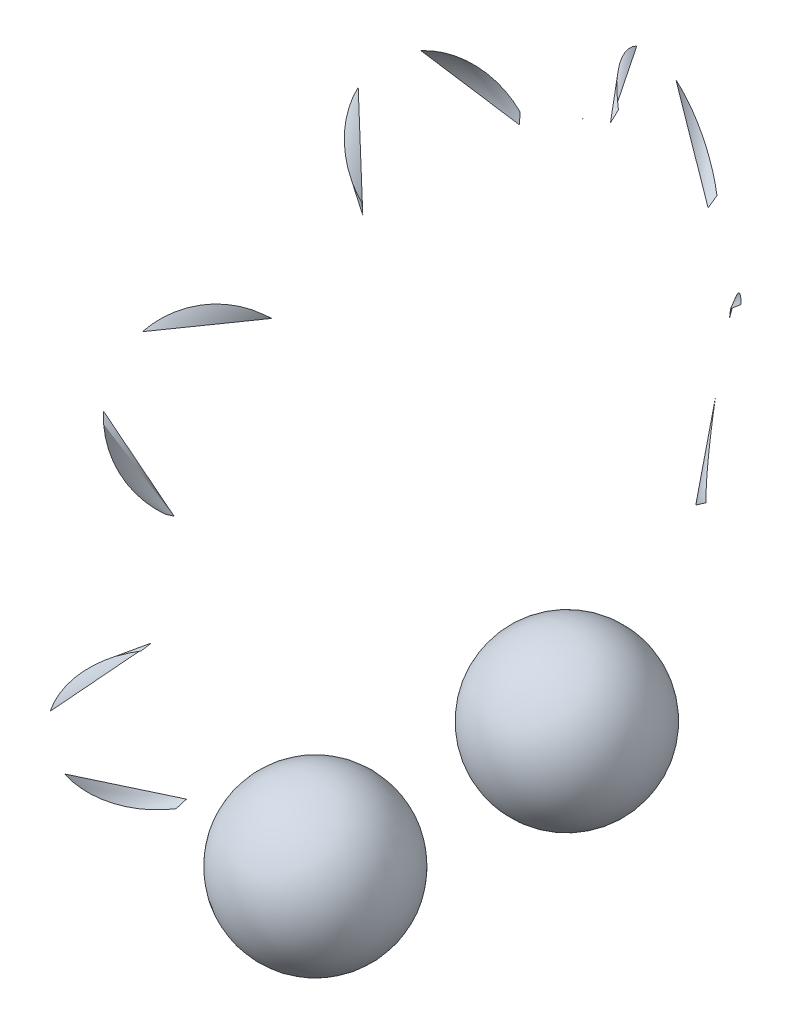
ISO-10303-21;
HEADER;
FILE_DESCRIPTION(('STEP AP214'),'2;1');
FILE_NAME('part.step','',(''),(''),'','','');
FILE_SCHEMA(('AUTOMOTIVE_DESIGN { 1 0 10303 214 1 1 1 1 }'));
ENDSEC;
DATA;
#1=APPLICATION_CONTEXT('core data for automotive mechanical design processes');
#2=APPLICATION_PROTOCOL_DEFINITION('international standard','automotive_design',2000,#1);
#3=PRODUCT_CONTEXT('',#1,'mechanical');
#4=PRODUCT('Part','Part','',(#3));
#5=PRODUCT_RELATED_PRODUCT_CATEGORY('part','',(#4));
#6=PRODUCT_DEFINITION_FORMATION('','',#4);
#7=PRODUCT_DEFINITION_CONTEXT('part definition',#1,'design');
#8=PRODUCT_DEFINITION('design','',#6,#7);
#9=PRODUCT_DEFINITION_SHAPE('','',#8);
#10=(LENGTH_UNIT() NAMED_UNIT(*) SI_UNIT(.MILLI.,.METRE.));
#11=(NAMED_UNIT(*) PLANE_ANGLE_UNIT() SI_UNIT($,.RADIAN.));
#12=(NAMED_UNIT(*) SI_UNIT($,.STERADIAN.) SOLID_ANGLE_UNIT());
#13=UNCERTAINTY_MEASURE_WITH_UNIT(LENGTH_MEASURE(1.E-05),#10,'distance_accuracy_value','');
#14=(GEOMETRIC_REPRESENTATION_CONTEXT(3) GLOBAL_UNCERTAINTY_ASSIGNED_CONTEXT((#13)) GLOBAL_UNIT_ASSIGNED_CONTEXT((#10,
#11,#12)) REPRESENTATION_CONTEXT('',''));
#15=CARTESIAN_POINT('',(0.,0.,0.));
#16=DIRECTION('',(0.,0.,1.));
#17=DIRECTION('',(1.,0.,0.));
#18=AXIS2_PLACEMENT_3D('',#15,#16,#17);
#19=CARTESIAN_POINT('',(11.120615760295,0.,0.));
#20=DIRECTION('',(1.,0.,0.));
#21=DIRECTION('',(0.,-1.,0.));
#22=AXIS2_PLACEMENT_3D('',#19,#20,#21);
#23=TOROIDAL_SURFACE('',#22,11.,0.0001);
#24=CARTESIAN_POINT('',(11.1205760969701,4.27978633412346,-10.1333828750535));
#25=CARTESIAN_POINT('',(11.1205709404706,4.2797851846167,-10.1333809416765));
#26=CARTESIAN_POINT('',(11.1205659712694,4.27978381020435,-10.1333786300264));
#27=CARTESIAN_POINT('',(11.1205565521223,4.27978065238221,-10.1333733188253));
#28=CARTESIAN_POINT('',(11.1205521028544,4.27977886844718,-10.1333703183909));
#29=CARTESIAN_POINT('',(11.1205438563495,4.27977494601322,-10.1333637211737));
#30=CARTESIAN_POINT('',(11.1205400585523,4.27977280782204,-10.1333601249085));
#31=CARTESIAN_POINT('',(11.1205332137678,4.279768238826,-10.1333524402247));
#32=CARTESIAN_POINT('',(11.1205301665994,4.27976580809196,-10.1333483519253));
#33=CARTESIAN_POINT('',(11.1205248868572,4.2797607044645,-10.1333397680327));
#34=CARTESIAN_POINT('',(11.1205226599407,4.27975803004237,-10.1333352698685));
#35=CARTESIAN_POINT('',(11.1205191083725,4.27975252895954,-10.1333260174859));
#36=CARTESIAN_POINT('',(11.1205177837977,4.27974970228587,-10.1333212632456));
#37=CARTESIAN_POINT('',(11.1205160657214,4.27974395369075,-10.1333115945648));
#38=CARTESIAN_POINT('',(11.1205156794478,4.27974103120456,-10.1333066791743));
#39=CARTESIAN_POINT('',(11.1205158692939,4.27973519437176,-10.1332968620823));
#40=CARTESIAN_POINT('',(11.1205164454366,4.27973228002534,-10.1332919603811));
#41=CARTESIAN_POINT('',(11.1205185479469,4.27972653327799,-10.1332822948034));
#42=CARTESIAN_POINT('',(11.1205200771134,4.27972370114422,-10.1332775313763));
#43=CARTESIAN_POINT('',(11.1205240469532,4.27971820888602,-10.1332682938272));
#44=CARTESIAN_POINT('',(11.1205264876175,4.27971554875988,-10.1332638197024));
#45=CARTESIAN_POINT('',(11.1205322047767,4.27971048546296,-10.1332553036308));
#46=CARTESIAN_POINT('',(11.1205354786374,4.27970808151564,-10.1332512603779));
#47=CARTESIAN_POINT('',(11.120542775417,4.27970359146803,-10.1332437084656));
#48=CARTESIAN_POINT('',(11.1205467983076,4.27970150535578,-10.133240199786));
#49=CARTESIAN_POINT('',(11.1205554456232,4.27969772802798,-10.1332338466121));
#50=CARTESIAN_POINT('',(11.120560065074,4.27969603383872,-10.1332309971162));
#51=CARTESIAN_POINT('',(11.1205697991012,4.27969307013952,-10.1332260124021));
#52=CARTESIAN_POINT('',(11.1205749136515,4.2796918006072,-10.1332238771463));
#53=CARTESIAN_POINT('',(11.120585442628,4.27968973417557,-10.1332204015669));
#54=CARTESIAN_POINT('',(11.1205908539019,4.27968893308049,-10.1332190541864));
#55=CARTESIAN_POINT('',(11.1206018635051,4.27968780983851,-10.1332171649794));
#56=CARTESIAN_POINT('',(11.1206074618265,4.27968748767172,-10.1332166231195));
#57=CARTESIAN_POINT('',(11.1206186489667,4.27968733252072,-10.1332163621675));
#58=CARTESIAN_POINT('',(11.1206242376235,4.27968749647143,-10.13321663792));
#59=CARTESIAN_POINT('',(11.1206352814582,4.27968830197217,-10.1332179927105));
#60=CARTESIAN_POINT('',(11.1206407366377,4.27968894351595,-10.133219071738));
#61=CARTESIAN_POINT('',(11.1206513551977,4.27969068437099,-10.1332219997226));
#62=CARTESIAN_POINT('',(11.1206565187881,4.27969178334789,-10.1332238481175));
#63=CARTESIAN_POINT('',(11.1206664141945,4.27969440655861,-10.1332282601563));
#64=CARTESIAN_POINT('',(11.1206711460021,4.27969593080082,-10.1332308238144));
#65=CARTESIAN_POINT('',(11.1206800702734,4.27969936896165,-10.133236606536));
#66=CARTESIAN_POINT('',(11.1206842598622,4.2797012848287,-10.1332398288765));
#67=CARTESIAN_POINT('',(11.1206919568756,4.27970544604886,-10.133246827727));
#68=CARTESIAN_POINT('',(11.1206954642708,4.27970769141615,-10.1332506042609));
#69=CARTESIAN_POINT('',(11.1207017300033,4.27971246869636,-10.1332586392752));
#70=CARTESIAN_POINT('',(11.1207044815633,4.2797150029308,-10.1332629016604));
#71=CARTESIAN_POINT('',(11.120709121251,4.27972027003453,-10.1332717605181));
#72=CARTESIAN_POINT('',(11.1207110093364,4.27972300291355,-10.133276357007));
#73=CARTESIAN_POINT('',(11.1207138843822,4.27972861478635,-10.1332857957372));
#74=CARTESIAN_POINT('',(11.1207148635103,4.27973149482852,-10.1332906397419));
#75=CARTESIAN_POINT('',(11.1207158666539,4.2797372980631,-10.1333004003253));
#76=CARTESIAN_POINT('',(11.1207158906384,4.27974022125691,-10.1333053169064));
#77=CARTESIAN_POINT('',(11.1207149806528,4.27974604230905,-10.1333151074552));
#78=CARTESIAN_POINT('',(11.1207140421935,4.27974893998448,-10.1333199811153));
#79=CARTESIAN_POINT('',(11.120711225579,4.279754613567,-10.1333295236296));
#80=CARTESIAN_POINT('',(11.1207093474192,4.27975738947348,-10.1333341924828));
#81=CARTESIAN_POINT('',(11.1207047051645,4.27976273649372,-10.1333431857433));
#82=CARTESIAN_POINT('',(11.1207019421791,4.27976530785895,-10.1333475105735));
#83=CARTESIAN_POINT('',(11.12069560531,4.27977017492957,-10.1333556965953));
#84=CARTESIAN_POINT('',(11.1206920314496,4.27977247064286,-10.1333595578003));
#85=CARTESIAN_POINT('',(11.1206841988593,4.27977670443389,-10.1333666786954));
#86=CARTESIAN_POINT('',(11.1206799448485,4.27977864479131,-10.1333699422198));
#87=CARTESIAN_POINT('',(11.1206708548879,4.27978212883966,-10.1333758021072));
#88=CARTESIAN_POINT('',(11.1206660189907,4.27978367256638,-10.1333783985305));
#89=CARTESIAN_POINT('',(11.1206559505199,4.27978630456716,-10.1333828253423));
#90=CARTESIAN_POINT('',(11.1206507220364,4.2797873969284,-10.1333846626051));
#91=CARTESIAN_POINT('',(11.1206399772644,4.27978911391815,-10.1333875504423));
#92=CARTESIAN_POINT('',(11.1206344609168,4.27978973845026,-10.1333886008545));
#93=CARTESIAN_POINT('',(11.1206233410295,4.27979049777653,-10.1333898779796));
#94=CARTESIAN_POINT('',(11.1206177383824,4.27979063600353,-10.1333901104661));
#95=CARTESIAN_POINT('',(11.12060657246,4.27979042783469,-10.1333897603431));
#96=CARTESIAN_POINT('',(11.1206010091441,4.27979008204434,-10.1333891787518));
#97=CARTESIAN_POINT('',(11.1205922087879,4.27978914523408,-10.1333876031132));
#98=CARTESIAN_POINT('',(11.1205889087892,4.27978870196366,-10.1333868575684));
#99=CARTESIAN_POINT('',(11.1205824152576,4.27978764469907,-10.1333850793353));
#100=CARTESIAN_POINT('',(11.1205792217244,4.27978703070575,-10.1333840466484));
#101=CARTESIAN_POINT('',(11.1205760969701,4.27978633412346,-10.1333828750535));
#102=B_SPLINE_CURVE_WITH_KNOTS('',3,(#24,#25,#26,#27,#28,#29,#30,#31,#32,#33,#34,#35,#36,#37,
#38,#39,#40,#41,#42,#43,#44,#45,#46,#47,#48,#49,#50,#51,#52,#53,#54,#55,#56,#57,#58,#59,#60,#61,
#62,#63,#64,#65,#66,#67,#68,#69,#70,#71,#72,#73,#74,#75,#76,#77,#78,#79,#80,#81,#82,#83,#84,#85,
#86,#87,#88,#89,#90,#91,#92,#93,#94,#95,#96,#97,#98,#99,#100,#101),.UNSPECIFIED.,.T.,.F.,(4,2,2,
2,2,2,2,2,2,2,2,2,2,2,2,2,2,2,2,2,2,2,2,2,2,2,2,2,2,2,2,2,2,2,2,2,2,2,4),(0.,
1.68646145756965E-05,3.37509810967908E-05,5.06227539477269E-05,6.7490451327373E-05,
8.44723992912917E-05,0.000101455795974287,0.000118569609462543,0.000135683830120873,
0.000152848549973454,0.000170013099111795,0.000187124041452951,0.000204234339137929,
0.000221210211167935,0.000238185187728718,0.000255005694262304,0.000271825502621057,
0.000288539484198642,0.000305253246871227,0.000321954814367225,0.00033865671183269,
0.000355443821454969,0.000372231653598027,0.000389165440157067,0.000406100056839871,
0.000423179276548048,0.00044025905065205,0.00045741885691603,0.000474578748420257,
0.000491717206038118,0.000508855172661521,0.000525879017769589,0.000542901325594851,
0.000559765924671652,0.000576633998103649,0.00059338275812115,0.000610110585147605,
0.000620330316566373,0.000630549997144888),.UNSPECIFIED.);
#103=CARTESIAN_POINT('',(11.1205760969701,4.27978633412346,-10.1333828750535));
#104=VERTEX_POINT('',#103);
#105=EDGE_CURVE('E10',#104,#104,#102,.T.);
#106=ORIENTED_EDGE('',*,*,#105,.F.);
#107=EDGE_LOOP('',(#106));
#108=FACE_BOUND('',#107,.T.);
#109=CARTESIAN_POINT('',(11.1205841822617,0.540755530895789,-10.9867952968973));
#110=CARTESIAN_POINT('',(11.1205894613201,0.540755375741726,-10.986797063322));
#111=CARTESIAN_POINT('',(11.1205948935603,0.54075525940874,-10.9867983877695));
#112=CARTESIAN_POINT('',(11.1206059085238,0.540755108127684,-10.9868001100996));
#113=CARTESIAN_POINT('',(11.1206114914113,0.540755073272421,-10.9868005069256));
#114=CARTESIAN_POINT('',(11.1206226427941,0.540755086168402,-10.9868003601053));
#115=CARTESIAN_POINT('',(11.1206282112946,0.540755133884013,-10.9867998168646));
#116=CARTESIAN_POINT('',(11.1206391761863,0.540755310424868,-10.9867978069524));
#117=CARTESIAN_POINT('',(11.120644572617,0.540755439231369,-10.9867963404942));
#118=CARTESIAN_POINT('',(11.1206550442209,0.540755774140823,-10.9867925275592));
#119=CARTESIAN_POINT('',(11.1206601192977,0.540755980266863,-10.9867901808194));
#120=CARTESIAN_POINT('',(11.120669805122,0.540756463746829,-10.9867846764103));
#121=CARTESIAN_POINT('',(11.1206744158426,0.54075674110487,-10.9867815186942));
#122=CARTESIAN_POINT('',(11.1206830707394,0.540757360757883,-10.9867744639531));
#123=CARTESIAN_POINT('',(11.1206871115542,0.54075770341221,-10.986770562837));
#124=CARTESIAN_POINT('',(11.1206944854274,0.540758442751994,-10.9867621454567));
#125=CARTESIAN_POINT('',(11.1206978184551,0.5407588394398,-10.9867576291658));
#126=CARTESIAN_POINT('',(11.1207037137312,0.540759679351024,-10.9867480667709));
#127=CARTESIAN_POINT('',(11.1207062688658,0.540760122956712,-10.9867430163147));
#128=CARTESIAN_POINT('',(11.1207104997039,0.540761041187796,-10.9867325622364));
#129=CARTESIAN_POINT('',(11.120712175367,0.54076151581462,-10.986727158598));
#130=CARTESIAN_POINT('',(11.120714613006,0.540762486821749,-10.9867161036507));
#131=CARTESIAN_POINT('',(11.1207153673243,0.540762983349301,-10.9867104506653));
#132=CARTESIAN_POINT('',(11.1207159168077,0.540763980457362,-10.9866990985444));
#133=CARTESIAN_POINT('',(11.1207157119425,0.540764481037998,-10.9866933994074));
#134=CARTESIAN_POINT('',(11.1207143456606,0.540765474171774,-10.9866820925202));
#135=CARTESIAN_POINT('',(11.1207131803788,0.540765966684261,-10.9866764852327));
#136=CARTESIAN_POINT('',(11.1207099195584,0.540766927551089,-10.9866655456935));
#137=CARTESIAN_POINT('',(11.1207078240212,0.540767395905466,-10.9866602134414));
#138=CARTESIAN_POINT('',(11.120702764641,0.540768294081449,-10.9866499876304));
#139=CARTESIAN_POINT('',(11.1206998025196,0.540768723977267,-10.9866450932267));
#140=CARTESIAN_POINT('',(11.1206930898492,0.540769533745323,-10.986635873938));
#141=CARTESIAN_POINT('',(11.1206893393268,0.540769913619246,-10.9866315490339));
#142=CARTESIAN_POINT('',(11.1206811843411,0.540770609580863,-10.9866236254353));
#143=CARTESIAN_POINT('',(11.1206767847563,0.54077092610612,-10.9866200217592));
#144=CARTESIAN_POINT('',(11.1206674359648,0.540771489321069,-10.986613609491));
#145=CARTESIAN_POINT('',(11.1206624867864,0.540771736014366,-10.9866108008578));
#146=CARTESIAN_POINT('',(11.1206522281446,0.540772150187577,-10.9866060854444));
#147=CARTESIAN_POINT('',(11.1206469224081,0.540772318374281,-10.9866041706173));
#148=CARTESIAN_POINT('',(11.120636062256,0.540772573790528,-10.9866012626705));
#149=CARTESIAN_POINT('',(11.1206305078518,0.540772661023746,-10.9866002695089));
#150=CARTESIAN_POINT('',(11.1206193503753,0.540772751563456,-10.9865992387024));
#151=CARTESIAN_POINT('',(11.1206137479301,0.540772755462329,-10.9865991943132));
#152=CARTESIAN_POINT('',(11.1206026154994,0.540772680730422,-10.9866000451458));
#153=CARTESIAN_POINT('',(11.1205970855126,0.540772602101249,-10.9866009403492));
#154=CARTESIAN_POINT('',(11.1205862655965,0.540772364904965,-10.9866036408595));
#155=CARTESIAN_POINT('',(11.1205809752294,0.54077220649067,-10.9866054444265));
#156=CARTESIAN_POINT('',(11.1205707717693,0.54077181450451,-10.9866099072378));
#157=CARTESIAN_POINT('',(11.1205658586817,0.540771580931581,-10.9866125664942));
#158=CARTESIAN_POINT('',(11.12055652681,0.540771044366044,-10.9866186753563));
#159=CARTESIAN_POINT('',(11.120552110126,0.540770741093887,-10.9866221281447));
#160=CARTESIAN_POINT('',(11.1205439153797,0.540770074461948,-10.9866297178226));
#161=CARTESIAN_POINT('',(11.1205401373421,0.540769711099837,-10.9866338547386));
#162=CARTESIAN_POINT('',(11.1205332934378,0.540768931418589,-10.9866427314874));
#163=CARTESIAN_POINT('',(11.1205302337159,0.540768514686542,-10.9866474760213));
#164=CARTESIAN_POINT('',(11.1205249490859,0.540767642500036,-10.9866574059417));
#165=CARTESIAN_POINT('',(11.1205227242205,0.5407671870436,-10.9866625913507));
#166=CARTESIAN_POINT('',(11.1205191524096,0.540766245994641,-10.9866733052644));
#167=CARTESIAN_POINT('',(11.1205178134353,0.540765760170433,-10.9866788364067));
#168=CARTESIAN_POINT('',(11.1205160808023,0.540764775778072,-10.9866900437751));
#169=CARTESIAN_POINT('',(11.1205156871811,0.540764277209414,-10.9866957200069));
#170=CARTESIAN_POINT('',(11.1205158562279,0.540763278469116,-10.9867070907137));
#171=CARTESIAN_POINT('',(11.1205164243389,0.540762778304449,-10.9867127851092));
#172=CARTESIAN_POINT('',(11.1205185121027,0.540761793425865,-10.986723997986));
#173=CARTESIAN_POINT('',(11.1205200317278,0.5407613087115,-10.9867295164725));
#174=CARTESIAN_POINT('',(11.1205239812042,0.54076036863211,-10.9867402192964));
#175=CARTESIAN_POINT('',(11.1205264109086,0.540759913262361,-10.9867454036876));
#176=CARTESIAN_POINT('',(11.1205321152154,0.540759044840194,-10.9867552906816));
#177=CARTESIAN_POINT('',(11.1205353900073,0.540758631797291,-10.986759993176));
#178=CARTESIAN_POINT('',(11.1205426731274,0.540757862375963,-10.9867687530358));
#179=CARTESIAN_POINT('',(11.1205466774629,0.540757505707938,-10.9867728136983));
#180=CARTESIAN_POINT('',(11.1205553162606,0.540756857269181,-10.9867801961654));
#181=CARTESIAN_POINT('',(11.1205599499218,0.54075656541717,-10.9867835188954));
#182=CARTESIAN_POINT('',(11.120567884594,0.540756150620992,-10.9867882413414));
#183=CARTESIAN_POINT('',(11.1205710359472,0.540756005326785,-10.9867898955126));
#184=CARTESIAN_POINT('',(11.1205774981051,0.540755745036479,-10.9867928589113));
#185=CARTESIAN_POINT('',(11.1205808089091,0.540755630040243,-10.9867941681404));
#186=CARTESIAN_POINT('',(11.1205841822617,0.540755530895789,-10.9867952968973));
#187=B_SPLINE_CURVE_WITH_KNOTS('',3,(#109,#110,#111,#112,#113,#114,#115,#116,#117,#118,#119,
#120,#121,#122,#123,#124,#125,#126,#127,#128,#129,#130,#131,#132,#133,#134,#135,#136,#137,#138,
#139,#140,#141,#142,#143,#144,#145,#146,#147,#148,#149,#150,#151,#152,#153,#154,#155,#156,#157,
#158,#159,#160,#161,#162,#163,#164,#165,#166,#167,#168,#169,#170,#171,#172,#173,#174,#175,#176,
#177,#178,#179,#180,#181,#182,#183,#184,#185,#186),.UNSPECIFIED.,.T.,.F.,(4,2,2,2,2,2,2,2,2,2,2,
2,2,2,2,2,2,2,2,2,2,2,2,2,2,2,2,2,2,2,2,2,2,2,2,2,2,2,4),(0.,1.66937832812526E-05,
3.34065726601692E-05,5.0112151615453E-05,6.68138705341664E-05,8.35205804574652E-05,
0.000100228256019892,0.000117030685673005,0.000133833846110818,0.000150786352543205,
0.000167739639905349,0.000184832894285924,0.000201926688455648,0.000219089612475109,
0.000236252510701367,0.000253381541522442,0.000270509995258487,0.000287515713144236,
0.000304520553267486,0.000321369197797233,0.000338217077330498,0.000354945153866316,
0.000371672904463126,0.000388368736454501,0.000405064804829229,0.000421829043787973,
0.000438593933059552,0.000455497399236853,0.000472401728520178,0.000489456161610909,
0.000506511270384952,0.000523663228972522,0.000540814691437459,0.000557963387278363,
0.00057511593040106,0.000592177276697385,0.000609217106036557,0.000619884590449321,
0.000630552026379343),.UNSPECIFIED.);
#188=CARTESIAN_POINT('',(11.1205841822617,0.540755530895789,-10.9867952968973));
#189=VERTEX_POINT('',#188);
#190=EDGE_CURVE('E34',#189,#189,#187,.T.);
#191=ORIENTED_EDGE('',*,*,#190,.F.);
#192=EDGE_LOOP('',(#191));
#193=FACE_BOUND('',#192,.T.);
#194=ADVANCED_FACE('F15',(#108,#193),#23,.T.);
#195=CARTESIAN_POINT('',(11.1205685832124,-5.25419332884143,-9.66412915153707));
#196=CARTESIAN_POINT('',(11.1205636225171,-5.25419238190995,-9.66412664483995));
#197=CARTESIAN_POINT('',(11.1205588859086,-5.25419128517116,-9.66412374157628));
#198=CARTESIAN_POINT('',(11.1205499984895,-5.25418882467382,-9.66411722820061));
#199=CARTESIAN_POINT('',(11.1205458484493,-5.25418746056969,-9.66411361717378));
#200=CARTESIAN_POINT('',(11.120538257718,-5.254184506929,-9.66410579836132));
#201=CARTESIAN_POINT('',(11.1205348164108,-5.25418291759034,-9.66410159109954));
#202=CARTESIAN_POINT('',(11.1205287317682,-5.25417955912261,-9.66409270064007));
#203=CARTESIAN_POINT('',(11.1205260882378,-5.25417779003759,-9.66408801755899));
#204=CARTESIAN_POINT('',(11.1205216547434,-5.25417410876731,-9.66407827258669));
#205=CARTESIAN_POINT('',(11.120519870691,-5.25417219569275,-9.66407320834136));
#206=CARTESIAN_POINT('',(11.1205172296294,-5.25416829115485,-9.66406287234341));
#207=CARTESIAN_POINT('',(11.1205163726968,-5.25416629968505,-9.66405760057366));
#208=CARTESIAN_POINT('',(11.1205156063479,-5.25416228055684,-9.66404696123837));
#209=CARTESIAN_POINT('',(11.1205157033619,-5.25416025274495,-9.66404159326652));
#210=CARTESIAN_POINT('',(11.120516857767,-5.25415623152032,-9.66403094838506));
#211=CARTESIAN_POINT('',(11.1205179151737,-5.25415423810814,-9.66402567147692));
#212=CARTESIAN_POINT('',(11.120520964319,-5.25415033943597,-9.6640153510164));
#213=CARTESIAN_POINT('',(11.1205229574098,-5.25414843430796,-9.66401030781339));
#214=CARTESIAN_POINT('',(11.1205278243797,-5.25414477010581,-9.66400060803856));
#215=CARTESIAN_POINT('',(11.1205306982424,-5.25414301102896,-9.66399595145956));
#216=CARTESIAN_POINT('',(11.1205372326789,-5.25413969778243,-9.6639871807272));
#217=CARTESIAN_POINT('',(11.1205408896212,-5.25413814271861,-9.66398306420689));
#218=CARTESIAN_POINT('',(11.1205488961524,-5.25413527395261,-9.66397547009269));
#219=CARTESIAN_POINT('',(11.1205532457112,-5.25413396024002,-9.66397199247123));
#220=CARTESIAN_POINT('',(11.1205624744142,-5.25413162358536,-9.66396580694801));
#221=CARTESIAN_POINT('',(11.1205673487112,-5.25413059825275,-9.66396309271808));
#222=CARTESIAN_POINT('',(11.1205775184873,-5.25412885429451,-9.66395847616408));
#223=CARTESIAN_POINT('',(11.1205828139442,-5.25412813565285,-9.66395657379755));
#224=CARTESIAN_POINT('',(11.1205936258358,-5.25412703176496,-9.66395365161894));
#225=CARTESIAN_POINT('',(11.12059913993,-5.25412664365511,-9.66395262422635));
#226=CARTESIAN_POINT('',(11.1206102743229,-5.25412620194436,-9.66395145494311));
#227=CARTESIAN_POINT('',(11.1206158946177,-5.25412614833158,-9.66395131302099));
#228=CARTESIAN_POINT('',(11.1206270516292,-5.2541263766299,-9.66395191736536));
#229=CARTESIAN_POINT('',(11.1206325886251,-5.25412665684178,-9.66395265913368));
#230=CARTESIAN_POINT('',(11.1206434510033,-5.25412754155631,-9.66395500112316));
#231=CARTESIAN_POINT('',(11.1206487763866,-5.25412814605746,-9.6639566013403));
#232=CARTESIAN_POINT('',(11.1206590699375,-5.25412966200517,-9.66396061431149));
#233=CARTESIAN_POINT('',(11.1206640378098,-5.25413057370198,-9.66396302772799));
#234=CARTESIAN_POINT('',(11.1206734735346,-5.2541326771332,-9.66396859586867));
#235=CARTESIAN_POINT('',(11.1206779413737,-5.25413386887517,-9.66397175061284));
#236=CARTESIAN_POINT('',(11.1206862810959,-5.2541365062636,-9.66397873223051));
#237=CARTESIAN_POINT('',(11.120690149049,-5.25413795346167,-9.66398256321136));
#238=CARTESIAN_POINT('',(11.1206971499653,-5.25414105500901,-9.6639907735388));
#239=CARTESIAN_POINT('',(11.1207002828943,-5.25414270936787,-9.66399515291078));
#240=CARTESIAN_POINT('',(11.1207057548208,-5.25414619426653,-9.66400437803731));
#241=CARTESIAN_POINT('',(11.1207080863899,-5.25414802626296,-9.66400922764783));
#242=CARTESIAN_POINT('',(11.1207118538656,-5.25415180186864,-9.66401922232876));
#243=CARTESIAN_POINT('',(11.12071328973,-5.25415374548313,-9.66402436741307));
#244=CARTESIAN_POINT('',(11.1207152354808,-5.25415770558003,-9.66403485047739));
#245=CARTESIAN_POINT('',(11.1207157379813,-5.25415972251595,-9.66404018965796));
#246=CARTESIAN_POINT('',(11.1207157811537,-5.25416375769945,-9.66405087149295));
#247=CARTESIAN_POINT('',(11.1207153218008,-5.25416577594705,-9.66405621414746));
#248=CARTESIAN_POINT('',(11.120713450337,-5.25416976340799,-9.6640667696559));
#249=CARTESIAN_POINT('',(11.1207120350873,-5.25417173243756,-9.66407198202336));
#250=CARTESIAN_POINT('',(11.1207082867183,-5.25417555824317,-9.66408210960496));
#251=CARTESIAN_POINT('',(11.1207059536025,-5.25417741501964,-9.66408702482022));
#252=CARTESIAN_POINT('',(11.1207004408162,-5.25418095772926,-9.6640964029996));
#253=CARTESIAN_POINT('',(11.120697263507,-5.25418264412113,-9.66410086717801));
#254=CARTESIAN_POINT('',(11.120690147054,-5.25418580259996,-9.66410922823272));
#255=CARTESIAN_POINT('',(11.1206862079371,-5.25418727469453,-9.66411312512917));
#256=CARTESIAN_POINT('',(11.120677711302,-5.25418995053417,-9.66412020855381));
#257=CARTESIAN_POINT('',(11.1206731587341,-5.254191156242,-9.66412340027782));
#258=CARTESIAN_POINT('',(11.1206635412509,-5.25419327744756,-9.66412901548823));
#259=CARTESIAN_POINT('',(11.1206584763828,-5.25419419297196,-9.66413143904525));
#260=CARTESIAN_POINT('',(11.1206480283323,-5.25419569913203,-9.66413542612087));
#261=CARTESIAN_POINT('',(11.1206426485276,-5.25419629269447,-9.66413699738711));
#262=CARTESIAN_POINT('',(11.1206316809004,-5.25419714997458,-9.66413926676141));
#263=CARTESIAN_POINT('',(11.1206260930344,-5.2541974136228,-9.6641399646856));
#264=CARTESIAN_POINT('',(11.1206149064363,-5.25419760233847,-9.66414046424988));
#265=CARTESIAN_POINT('',(11.1206093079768,-5.25419752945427,-9.66414027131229));
#266=CARTESIAN_POINT('',(11.1205982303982,-5.25419705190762,-9.66413900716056));
#267=CARTESIAN_POINT('',(11.1205927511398,-5.25419664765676,-9.66413793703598));
#268=CARTESIAN_POINT('',(11.120584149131,-5.25419574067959,-9.66413553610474));
#269=CARTESIAN_POINT('',(11.1205809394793,-5.25419533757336,-9.66413446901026));
#270=CARTESIAN_POINT('',(11.1205746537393,-5.25419441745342,-9.6641320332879));
#271=CARTESIAN_POINT('',(11.1205715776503,-5.25419390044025,-9.66413066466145));
#272=CARTESIAN_POINT('',(11.1205685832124,-5.25419332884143,-9.66412915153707));
#273=B_SPLINE_CURVE_WITH_KNOTS('',3,(#195,#196,#197,#198,#199,#200,#201,#202,#203,#204,#205,
#206,#207,#208,#209,#210,#211,#212,#213,#214,#215,#216,#217,#218,#219,#220,#221,#222,#223,#224,
#225,#226,#227,#228,#229,#230,#231,#232,#233,#234,#235,#236,#237,#238,#239,#240,#241,#242,#243,
#244,#245,#246,#247,#248,#249,#250,#251,#252,#253,#254,#255,#256,#257,#258,#259,#260,#261,#262,
#263,#264,#265,#266,#267,#268,#269,#270,#271,#272),.UNSPECIFIED.,.T.,.F.,(4,2,2,2,2,2,2,2,2,2,2,
2,2,2,2,2,2,2,2,2,2,2,2,2,2,2,2,2,2,2,2,2,2,2,2,2,2,2,4),(0.,1.69018923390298E-05,
3.38257772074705E-05,5.07348840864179E-05,6.76398571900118E-05,8.46595026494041E-05,
0.000101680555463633,0.000118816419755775,0.000135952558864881,0.000153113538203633,
0.00017027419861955,0.000187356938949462,0.000204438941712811,0.000221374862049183,
0.000238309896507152,0.00025509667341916,0.000271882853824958,0.00028858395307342,
0.000305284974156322,0.0003219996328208,0.000338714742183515,0.000355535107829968,
0.000372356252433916,0.000389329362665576,0.000406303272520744,0.000423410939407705,
0.000440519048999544,0.000457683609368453,0.000474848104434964,0.000491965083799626,
0.000509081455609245,0.000526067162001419,0.000543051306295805,0.000559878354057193,
0.000576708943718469,0.000593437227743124,0.00061014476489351,0.000620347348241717,
0.000630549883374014),.UNSPECIFIED.);
#274=CARTESIAN_POINT('',(11.1205685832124,-5.25419332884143,-9.66412915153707));
#275=VERTEX_POINT('',#274);
#276=EDGE_CURVE('E30',#275,#275,#273,.T.);
#277=ORIENTED_EDGE('',*,*,#276,.F.);
#278=EDGE_LOOP('',(#277));
#279=FACE_BOUND('',#278,.T.);
#280=CARTESIAN_POINT('',(11.1205759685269,-8.25266425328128,-7.27293276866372));
#281=CARTESIAN_POINT('',(11.120581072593,-8.25266611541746,-7.27293400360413));
#282=CARTESIAN_POINT('',(11.1205863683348,-8.25266762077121,-7.2729350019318));
#283=CARTESIAN_POINT('',(11.1205971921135,-8.25266987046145,-7.27293649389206));
#284=CARTESIAN_POINT('',(11.1206027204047,-8.252670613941,-7.27293698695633));
#285=CARTESIAN_POINT('',(11.1206138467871,-8.25267131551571,-7.27293745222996));
#286=CARTESIAN_POINT('',(11.1206194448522,-8.25267127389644,-7.2729374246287));
#287=CARTESIAN_POINT('',(11.1206305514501,-8.25267040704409,-7.27293684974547));
#288=CARTESIAN_POINT('',(11.1206360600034,-8.25266958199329,-7.27293630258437));
#289=CARTESIAN_POINT('',(11.1206468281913,-8.25266717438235,-7.27293470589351));
#290=CARTESIAN_POINT('',(11.120652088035,-8.25266559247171,-7.27293365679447));
#291=CARTESIAN_POINT('',(11.120662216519,-8.25266171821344,-7.27293108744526));
#292=CARTESIAN_POINT('',(11.1206670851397,-8.25265942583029,-7.27292956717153));
#293=CARTESIAN_POINT('',(11.1206763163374,-8.25265418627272,-7.27292609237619));
#294=CARTESIAN_POINT('',(11.1206806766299,-8.25265123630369,-7.27292413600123));
#295=CARTESIAN_POINT('',(11.1206887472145,-8.25264477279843,-7.27291984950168));
#296=CARTESIAN_POINT('',(11.120692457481,-8.25264125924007,-7.2729175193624));
#297=CARTESIAN_POINT('',(11.1206991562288,-8.2526337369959,-7.27291253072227));
#298=CARTESIAN_POINT('',(11.1207021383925,-8.25262972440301,-7.2729098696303));
#299=CARTESIAN_POINT('',(11.1207072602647,-8.25262134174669,-7.27290431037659));
#300=CARTESIAN_POINT('',(11.1207093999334,-8.25261697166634,-7.27290141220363));
#301=CARTESIAN_POINT('',(11.1207127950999,-8.25260795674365,-7.27289543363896));
#302=CARTESIAN_POINT('',(11.1207140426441,-8.25260330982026,-7.27289235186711));
#303=CARTESIAN_POINT('',(11.120715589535,-8.25259390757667,-7.27288611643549));
#304=CARTESIAN_POINT('',(11.1207158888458,-8.25258915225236,-7.272882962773));
#305=CARTESIAN_POINT('',(11.1207155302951,-8.25257964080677,-7.27287665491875));
#306=CARTESIAN_POINT('',(11.1207148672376,-8.25257488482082,-7.27287350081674));
#307=CARTESIAN_POINT('',(11.1207125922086,-8.25256553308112,-7.27286729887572));
#308=CARTESIAN_POINT('',(11.12071098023,-8.25256093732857,-7.27286425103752));
#309=CARTESIAN_POINT('',(11.120706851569,-8.25255203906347,-7.27285834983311));
#310=CARTESIAN_POINT('',(11.1207043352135,-8.25254773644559,-7.27285549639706));
#311=CARTESIAN_POINT('',(11.1206984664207,-8.25253954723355,-7.27285006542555));
#312=CARTESIAN_POINT('',(11.120695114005,-8.25253566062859,-7.27284748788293));
#313=CARTESIAN_POINT('',(11.1206876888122,-8.25252843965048,-7.27284269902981));
#314=CARTESIAN_POINT('',(11.120683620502,-8.25252510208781,-7.27284048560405));
#315=CARTESIAN_POINT('',(11.1206748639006,-8.25251904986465,-7.27283647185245));
#316=CARTESIAN_POINT('',(11.1206701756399,-8.25251633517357,-7.27283467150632));
#317=CARTESIAN_POINT('',(11.120660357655,-8.25251163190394,-7.27283155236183));
#318=CARTESIAN_POINT('',(11.1206552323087,-8.25250963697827,-7.27283022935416));
#319=CARTESIAN_POINT('',(11.1206446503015,-8.25250639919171,-7.27282808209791));
#320=CARTESIAN_POINT('',(11.120639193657,-8.25250515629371,-7.27282725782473));
#321=CARTESIAN_POINT('',(11.1206281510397,-8.25250346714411,-7.27282613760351));
#322=CARTESIAN_POINT('',(11.1206225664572,-8.25250301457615,-7.27282583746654));
#323=CARTESIAN_POINT('',(11.1206113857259,-8.25250290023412,-7.27282576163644));
#324=CARTESIAN_POINT('',(11.1206057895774,-8.25250323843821,-7.27282598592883));
#325=CARTESIAN_POINT('',(11.1205947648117,-8.25250469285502,-7.27282695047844));
#326=CARTESIAN_POINT('',(11.1205893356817,-8.25250580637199,-7.27282768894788));
#327=CARTESIAN_POINT('',(11.1205787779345,-8.25250877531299,-7.27282965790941));
#328=CARTESIAN_POINT('',(11.1205736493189,-8.25251063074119,-7.27283088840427));
#329=CARTESIAN_POINT('',(11.1205638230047,-8.25251503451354,-7.27283380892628));
#330=CARTESIAN_POINT('',(11.1205591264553,-8.2525175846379,-7.27283550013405));
#331=CARTESIAN_POINT('',(11.120550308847,-8.25252330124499,-7.27283929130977));
#332=CARTESIAN_POINT('',(11.1205461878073,-8.25252646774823,-7.27284139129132));
#333=CARTESIAN_POINT('',(11.1205386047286,-8.25253335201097,-7.27284595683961));
#334=CARTESIAN_POINT('',(11.1205351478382,-8.25253707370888,-7.27284842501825));
#335=CARTESIAN_POINT('',(11.1205290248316,-8.2525449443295,-7.27285364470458));
#336=CARTESIAN_POINT('',(11.1205263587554,-8.25254909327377,-7.27285639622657));
#337=CARTESIAN_POINT('',(11.1205218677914,-8.2525577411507,-7.27286213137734));
#338=CARTESIAN_POINT('',(11.1205200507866,-8.25256224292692,-7.27286511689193));
#339=CARTESIAN_POINT('',(11.1205173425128,-8.25257143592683,-7.27287121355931));
#340=CARTESIAN_POINT('',(11.120516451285,-8.25257612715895,-7.27287432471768));
#341=CARTESIAN_POINT('',(11.1205156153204,-8.25258560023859,-7.27288060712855));
#342=CARTESIAN_POINT('',(11.1205156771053,-8.2525903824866,-7.27288377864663));
#343=CARTESIAN_POINT('',(11.1205167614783,-8.25259987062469,-7.27289007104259));
#344=CARTESIAN_POINT('',(11.1205177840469,-8.25260457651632,-7.27289319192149));
#345=CARTESIAN_POINT('',(11.1205207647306,-8.25261378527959,-7.27289929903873));
#346=CARTESIAN_POINT('',(11.1205227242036,-8.25261828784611,-7.27290228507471));
#347=CARTESIAN_POINT('',(11.1205275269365,-8.25262695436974,-7.27290803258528));
#348=CARTESIAN_POINT('',(11.1205303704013,-8.25263111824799,-7.27291079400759));
#349=CARTESIAN_POINT('',(11.1205368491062,-8.25263896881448,-7.27291600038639));
#350=CARTESIAN_POINT('',(11.1205404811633,-8.25264265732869,-7.27291844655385));
#351=CARTESIAN_POINT('',(11.1205484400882,-8.25264946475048,-7.27292296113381));
#352=CARTESIAN_POINT('',(11.1205527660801,-8.25265258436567,-7.2729250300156));
#353=CARTESIAN_POINT('',(11.1205602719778,-8.25265712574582,-7.27292804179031));
#354=CARTESIAN_POINT('',(11.1205632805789,-8.25265874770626,-7.27292911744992));
#355=CARTESIAN_POINT('',(11.1205694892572,-8.25266171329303,-7.27293108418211));
#356=CARTESIAN_POINT('',(11.1205726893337,-8.25266305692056,-7.27293197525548));
#357=CARTESIAN_POINT('',(11.1205759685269,-8.25266425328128,-7.27293276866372));
#358=B_SPLINE_CURVE_WITH_KNOTS('',3,(#280,#281,#282,#283,#284,#285,#286,#287,#288,#289,#290,
#291,#292,#293,#294,#295,#296,#297,#298,#299,#300,#301,#302,#303,#304,#305,#306,#307,#308,#309,
#310,#311,#312,#313,#314,#315,#316,#317,#318,#319,#320,#321,#322,#323,#324,#325,#326,#327,#328,
#329,#330,#331,#332,#333,#334,#335,#336,#337,#338,#339,#340,#341,#342,#343,#344,#345,#346,#347,
#348,#349,#350,#351,#352,#353,#354,#355,#356,#357),.UNSPECIFIED.,.T.,.F.,(4,2,2,2,2,2,2,2,2,2,2,
2,2,2,2,2,2,2,2,2,2,2,2,2,2,2,2,2,2,2,2,2,2,2,2,2,2,2,4),(0.,1.67021709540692E-05,
3.34231080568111E-05,5.01379634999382E-05,6.68489311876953E-05,8.35455842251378E-05,
0.000100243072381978,0.000117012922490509,0.000133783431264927,0.000150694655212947,
0.000167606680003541,0.000184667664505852,0.000201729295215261,0.000218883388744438,
0.000236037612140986,0.00025318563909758,0.000270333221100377,0.000287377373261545,
0.000304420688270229,0.000321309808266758,0.000338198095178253,0.000354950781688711,
0.00037170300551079,0.000388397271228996,0.000405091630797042,0.000421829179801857,
0.00043856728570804,0.00045543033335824,0.000472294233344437,0.000489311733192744,
0.000506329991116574,0.000523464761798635,0.000540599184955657,0.000557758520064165,
0.000574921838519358,0.000592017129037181,0.000609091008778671,0.000619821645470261,
0.000630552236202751),.UNSPECIFIED.);
#359=CARTESIAN_POINT('',(11.1205759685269,-8.25266425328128,-7.27293276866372));
#360=VERTEX_POINT('',#359);
#361=EDGE_CURVE('E59',#360,#360,#358,.T.);
#362=ORIENTED_EDGE('',*,*,#361,.F.);
#363=EDGE_LOOP('',(#362));
#364=FACE_BOUND('',#363,.T.);
#365=ADVANCED_FACE('F140',(#279,#364),#23,.T.);
#366=CARTESIAN_POINT('',(11.1205717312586,8.92697428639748,-6.42737157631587));
#367=CARTESIAN_POINT('',(11.1205767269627,8.92697607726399,-6.42737328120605));
#368=CARTESIAN_POINT('',(11.1205819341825,8.92697756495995,-6.42737469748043));
#369=CARTESIAN_POINT('',(11.1205926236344,8.92697988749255,-6.4273769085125));
#370=CARTESIAN_POINT('',(11.1205981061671,8.92698072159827,-6.42737770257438));
#371=CARTESIAN_POINT('',(11.1206091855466,8.92698171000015,-6.42737864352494));
#372=CARTESIAN_POINT('',(11.1206147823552,8.92698186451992,-6.42737879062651));
#373=CARTESIAN_POINT('',(11.1206259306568,8.92698148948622,-6.42737843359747));
#374=CARTESIAN_POINT('',(11.12063148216,8.92698096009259,-6.42737792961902));
#375=CARTESIAN_POINT('',(11.1206423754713,8.92697923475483,-6.42737628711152));
#376=CARTESIAN_POINT('',(11.1206477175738,8.92697803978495,-6.42737514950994));
#377=CARTESIAN_POINT('',(11.1206580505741,8.92697501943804,-6.42737227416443));
#378=CARTESIAN_POINT('',(11.1206630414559,8.92697319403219,-6.42737053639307));
#379=CARTESIAN_POINT('',(11.1206725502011,8.92696895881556,-6.42736650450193));
#380=CARTESIAN_POINT('',(11.1206770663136,8.92696654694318,-6.42736420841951));
#381=CARTESIAN_POINT('',(11.1206854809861,8.92696121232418,-6.42735912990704));
#382=CARTESIAN_POINT('',(11.1206893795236,8.9269582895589,-6.42735634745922));
#383=CARTESIAN_POINT('',(11.1206964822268,8.92695199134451,-6.42735035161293));
#384=CARTESIAN_POINT('',(11.1206996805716,8.92694861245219,-6.42734713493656));
#385=CARTESIAN_POINT('',(11.1207052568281,8.92694151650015,-6.42734037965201));
#386=CARTESIAN_POINT('',(11.1207076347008,8.92693779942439,-6.42733684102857));
#387=CARTESIAN_POINT('',(11.1207115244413,8.92693009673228,-6.42732950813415));
#388=CARTESIAN_POINT('',(11.1207130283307,8.92692610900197,-6.42732571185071));
#389=CARTESIAN_POINT('',(11.1207150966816,8.92691800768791,-6.42731799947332));
#390=CARTESIAN_POINT('',(11.1207156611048,8.92691389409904,-6.42731408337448));
#391=CARTESIAN_POINT('',(11.1207158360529,8.92690563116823,-6.42730621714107));
#392=CARTESIAN_POINT('',(11.1207154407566,8.92690148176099,-6.42730226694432));
#393=CARTESIAN_POINT('',(11.1207136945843,8.92689328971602,-6.42729446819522));
#394=CARTESIAN_POINT('',(11.1207123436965,8.92688924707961,-6.42729061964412));
#395=CARTESIAN_POINT('',(11.1207087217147,8.92688138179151,-6.42728313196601));
#396=CARTESIAN_POINT('',(11.1207064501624,8.92687755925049,-6.42727949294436));
#397=CARTESIAN_POINT('',(11.1207010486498,8.92687024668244,-6.42727253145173));
#398=CARTESIAN_POINT('',(11.120697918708,8.92686675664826,-6.42726920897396));
#399=CARTESIAN_POINT('',(11.1206909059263,8.92686022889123,-6.4272629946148));
#400=CARTESIAN_POINT('',(11.1206870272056,8.92685718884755,-6.427260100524));
#401=CARTESIAN_POINT('',(11.1206786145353,8.92685162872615,-6.42725480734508));
#402=CARTESIAN_POINT('',(11.1206740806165,8.92684910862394,-6.42725240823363));
#403=CARTESIAN_POINT('',(11.1206645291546,8.92684468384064,-6.42724819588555));
#404=CARTESIAN_POINT('',(11.1206595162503,8.92684277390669,-6.42724637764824));
#405=CARTESIAN_POINT('',(11.1206491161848,8.92683959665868,-6.42724335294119));
#406=CARTESIAN_POINT('',(11.1206437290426,8.92683832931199,-6.42724214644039));
#407=CARTESIAN_POINT('',(11.120632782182,8.92683648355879,-6.42724038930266));
#408=CARTESIAN_POINT('',(11.1206272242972,8.92683589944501,-6.42723983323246));
#409=CARTESIAN_POINT('',(11.1206160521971,8.92683541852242,-6.42723937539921));
#410=CARTESIAN_POINT('',(11.1206104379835,8.92683552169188,-6.42723947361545));
#411=CARTESIAN_POINT('',(11.1205993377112,8.92683641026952,-6.42724031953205));
#412=CARTESIAN_POINT('',(11.12059385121,8.92683719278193,-6.42724106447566));
#413=CARTESIAN_POINT('',(11.1205831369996,8.92683941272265,-6.42724317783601));
#414=CARTESIAN_POINT('',(11.1205779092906,8.9268408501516,-6.42724454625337));
#415=CARTESIAN_POINT('',(11.1205678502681,8.92684434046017,-6.42724786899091));
#416=CARTESIAN_POINT('',(11.1205630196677,8.92684639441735,-6.4272498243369));
#417=CARTESIAN_POINT('',(11.1205538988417,8.92685105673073,-6.42725426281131));
#418=CARTESIAN_POINT('',(11.1205496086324,8.92685366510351,-6.42725674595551));
#419=CARTESIAN_POINT('',(11.1205416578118,8.92685938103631,-6.42726218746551));
#420=CARTESIAN_POINT('',(11.1205380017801,8.92686249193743,-6.42726514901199));
#421=CARTESIAN_POINT('',(11.1205314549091,8.92686911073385,-6.42727145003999));
#422=CARTESIAN_POINT('',(11.1205285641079,8.92687261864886,-6.42727478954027));
#423=CARTESIAN_POINT('',(11.120523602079,8.92687996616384,-6.42728178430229));
#424=CARTESIAN_POINT('',(11.1205215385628,8.92688380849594,-6.42728544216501));
#425=CARTESIAN_POINT('',(11.1205183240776,8.92689168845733,-6.42729294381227));
#426=CARTESIAN_POINT('',(11.1205171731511,8.92689572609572,-6.42729678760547));
#427=CARTESIAN_POINT('',(11.1205158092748,8.92690391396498,-6.42730458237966));
#428=CARTESIAN_POINT('',(11.1205156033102,8.9269080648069,-6.42730853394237));
#429=CARTESIAN_POINT('',(11.120516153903,8.9269163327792,-6.42731640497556));
#430=CARTESIAN_POINT('',(11.1205169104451,8.92692044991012,-6.42732032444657));
#431=CARTESIAN_POINT('',(11.1205193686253,8.92692854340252,-6.42732802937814));
#432=CARTESIAN_POINT('',(11.1205210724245,8.92693251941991,-6.42733181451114));
#433=CARTESIAN_POINT('',(11.1205253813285,8.92694020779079,-6.42733913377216));
#434=CARTESIAN_POINT('',(11.1205279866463,8.92694392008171,-6.42734266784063));
#435=CARTESIAN_POINT('',(11.1205340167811,8.92695096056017,-6.42734937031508));
#436=CARTESIAN_POINT('',(11.1205374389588,8.92695428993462,-6.427352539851));
#437=CARTESIAN_POINT('',(11.1205450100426,8.92696047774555,-6.42735843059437));
#438=CARTESIAN_POINT('',(11.1205491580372,8.92696333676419,-6.42736115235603));
#439=CARTESIAN_POINT('',(11.1205564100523,8.9269675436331,-6.42736515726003));
#440=CARTESIAN_POINT('',(11.1205593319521,8.9269690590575,-6.42736659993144));
#441=CARTESIAN_POINT('',(11.1205653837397,8.92697185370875,-6.42736926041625));
#442=CARTESIAN_POINT('',(11.1205685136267,8.92697313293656,-6.42737047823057));
#443=CARTESIAN_POINT('',(11.1205717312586,8.92697428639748,-6.42737157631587));
#444=B_SPLINE_CURVE_WITH_KNOTS('',3,(#366,#367,#368,#369,#370,#371,#372,#373,#374,#375,#376,
#377,#378,#379,#380,#381,#382,#383,#384,#385,#386,#387,#388,#389,#390,#391,#392,#393,#394,#395,
#396,#397,#398,#399,#400,#401,#402,#403,#404,#405,#406,#407,#408,#409,#410,#411,#412,#413,#414,
#415,#416,#417,#418,#419,#420,#421,#422,#423,#424,#425,#426,#427,#428,#429,#430,#431,#432,#433,
#434,#435,#436,#437,#438,#439,#440,#441,#442,#443),.UNSPECIFIED.,.T.,.F.,(4,2,2,2,2,2,2,2,2,2,2,
2,2,2,2,2,2,2,2,2,2,2,2,2,2,2,2,2,2,2,2,2,2,2,2,2,2,2,4),(0.,1.67093572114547E-05,
3.34373737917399E-05,5.01598854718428E-05,6.68784899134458E-05,8.35726864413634E-05,
0.000100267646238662,0.000117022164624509,0.000133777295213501,0.000150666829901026,
0.000167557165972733,0.000184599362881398,0.000201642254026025,0.000218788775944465,
0.000235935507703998,0.000253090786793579,0.00027024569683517,0.000287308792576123,
0.000304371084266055,0.000321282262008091,0.000338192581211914,0.000354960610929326,
0.000371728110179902,0.000388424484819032,0.000405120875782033,0.000421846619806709,
0.00043857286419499,0.000455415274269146,0.000472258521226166,0.000489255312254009,
0.000506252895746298,0.000523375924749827,0.000540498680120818,0.000557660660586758,
0.000574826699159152,0.00059193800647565,0.000609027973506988,0.000619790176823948,
0.000630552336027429),.UNSPECIFIED.);
#445=CARTESIAN_POINT('',(11.1205717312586,8.92697428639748,-6.42737157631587));
#446=VERTEX_POINT('',#445);
#447=EDGE_CURVE('E26',#446,#446,#444,.T.);
#448=ORIENTED_EDGE('',*,*,#447,.F.);
#449=EDGE_LOOP('',(#448));
#450=FACE_BOUND('',#449,.T.);
#451=CARTESIAN_POINT('',(11.1205750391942,10.5908177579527,-2.9719639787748));
#452=CARTESIAN_POINT('',(11.1205801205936,10.5908154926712,-2.97196366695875));
#453=CARTESIAN_POINT('',(11.1205853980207,10.5908136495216,-2.97196341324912));
#454=CARTESIAN_POINT('',(11.120596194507,10.5908108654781,-2.97196303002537));
#455=CARTESIAN_POINT('',(11.1206017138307,10.5908099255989,-2.97196290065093));
#456=CARTESIAN_POINT('',(11.1206128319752,10.5908089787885,-2.97196277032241));
#457=CARTESIAN_POINT('',(11.1206184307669,10.5908089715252,-2.97196276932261));
#458=CARTESIAN_POINT('',(11.1206295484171,10.5908098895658,-2.97196289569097));
#459=CARTESIAN_POINT('',(11.1206350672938,10.5908108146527,-2.97196302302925));
#460=CARTESIAN_POINT('',(11.1206458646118,10.5908135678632,-2.97196340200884));
#461=CARTESIAN_POINT('',(11.1206511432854,10.5908153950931,-2.97196365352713));
#462=CARTESIAN_POINT('',(11.1206613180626,10.5908198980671,-2.9719642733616));
#463=CARTESIAN_POINT('',(11.1206662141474,10.5908225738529,-2.97196464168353));
#464=CARTESIAN_POINT('',(11.1206755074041,10.5908287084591,-2.9719654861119));
#465=CARTESIAN_POINT('',(11.1206799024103,10.5908321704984,-2.97196596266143));
#466=CARTESIAN_POINT('',(11.1206880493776,10.5908397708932,-2.97196700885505));
#467=CARTESIAN_POINT('',(11.1206918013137,10.5908439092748,-2.97196757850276));
#468=CARTESIAN_POINT('',(11.1206985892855,10.5908527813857,-2.9719687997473));
#469=CARTESIAN_POINT('',(11.1207016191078,10.59085751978,-2.97196945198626));
#470=CARTESIAN_POINT('',(11.1207068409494,10.590867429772,-2.97197081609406));
#471=CARTESIAN_POINT('',(11.1207090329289,10.5908726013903,-2.97197152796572));
#472=CARTESIAN_POINT('',(11.1207125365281,10.5908832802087,-2.97197299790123));
#473=CARTESIAN_POINT('',(11.120713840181,10.5908887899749,-2.97197375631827));
#474=CARTESIAN_POINT('',(11.1207155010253,10.5908999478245,-2.97197529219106));
#475=CARTESIAN_POINT('',(11.1207158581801,10.5909055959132,-2.97197606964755));
#476=CARTESIAN_POINT('',(11.1207156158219,10.5909169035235,-2.97197762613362));
#477=CARTESIAN_POINT('',(11.1207150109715,10.5909225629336,-2.97197840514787));
#478=CARTESIAN_POINT('',(11.1207128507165,10.5909337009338,-2.97197993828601));
#479=CARTESIAN_POINT('',(11.1207112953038,10.5909391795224,-2.97198069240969));
#480=CARTESIAN_POINT('',(11.1207072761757,10.5909497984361,-2.97198215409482));
#481=CARTESIAN_POINT('',(11.1207048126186,10.59095493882,-2.97198286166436));
#482=CARTESIAN_POINT('',(11.1206990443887,10.5909647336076,-2.97198420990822));
#483=CARTESIAN_POINT('',(11.1206957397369,10.5909693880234,-2.97198485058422));
#484=CARTESIAN_POINT('',(11.1206884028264,10.5909780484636,-2.97198604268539));
#485=CARTESIAN_POINT('',(11.1206843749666,10.5909820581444,-2.97198659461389));
#486=CARTESIAN_POINT('',(11.1206756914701,10.5909893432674,-2.97198759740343));
#487=CARTESIAN_POINT('',(11.1206710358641,10.5909926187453,-2.9719880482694));
#488=CARTESIAN_POINT('',(11.1206612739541,10.5909983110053,-2.97198883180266));
#489=CARTESIAN_POINT('',(11.1206561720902,10.5910007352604,-2.97198916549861));
#490=CARTESIAN_POINT('',(11.1206456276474,10.5910046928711,-2.97198971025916));
#491=CARTESIAN_POINT('',(11.1206401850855,10.5910062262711,-2.97198992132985));
#492=CARTESIAN_POINT('',(11.1206291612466,10.5910083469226,-2.97199021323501));
#493=CARTESIAN_POINT('',(11.1206235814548,10.5910089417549,-2.97199029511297));
#494=CARTESIAN_POINT('',(11.1206124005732,10.5910091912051,-2.97199032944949));
#495=CARTESIAN_POINT('',(11.120606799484,10.5910088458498,-2.97199028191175));
#496=CARTESIAN_POINT('',(11.1205957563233,10.5910072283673,-2.9719900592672));
#497=CARTESIAN_POINT('',(11.1205903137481,10.5910059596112,-2.97198988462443));
#498=CARTESIAN_POINT('',(11.12057972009,10.591002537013,-2.97198941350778));
#499=CARTESIAN_POINT('',(11.1205745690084,10.5910003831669,-2.97198911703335));
#500=CARTESIAN_POINT('',(11.1205646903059,10.5909952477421,-2.97198841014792));
#501=CARTESIAN_POINT('',(11.1205599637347,10.5909922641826,-2.97198799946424));
#502=CARTESIAN_POINT('',(11.1205510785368,10.5909855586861,-2.97198707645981));
#503=CARTESIAN_POINT('',(11.1205469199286,10.5909818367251,-2.97198656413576));
#504=CARTESIAN_POINT('',(11.1205392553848,10.5909737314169,-2.97198544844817));
#505=CARTESIAN_POINT('',(11.1205357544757,10.5909693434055,-2.97198484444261));
#506=CARTESIAN_POINT('',(11.1205295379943,10.5909600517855,-2.97198356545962));
#507=CARTESIAN_POINT('',(11.1205268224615,10.590955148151,-2.97198289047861));
#508=CARTESIAN_POINT('',(11.1205222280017,10.5909449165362,-2.97198148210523));
#509=CARTESIAN_POINT('',(11.1205203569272,10.5909395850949,-2.97198074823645));
#510=CARTESIAN_POINT('',(11.1205175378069,10.5909286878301,-2.97197924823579));
#511=CARTESIAN_POINT('',(11.1205165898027,10.5909231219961,-2.97197848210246));
#512=CARTESIAN_POINT('',(11.120515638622,10.5909118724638,-2.97197693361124));
#513=CARTESIAN_POINT('',(11.120515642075,10.5909061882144,-2.97197615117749));
#514=CARTESIAN_POINT('',(11.1205166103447,10.5908949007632,-2.97197459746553));
#515=CARTESIAN_POINT('',(11.1205175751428,10.5908892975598,-2.97197382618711));
#516=CARTESIAN_POINT('',(11.1205204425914,10.5908783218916,-2.97197231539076));
#517=CARTESIAN_POINT('',(11.1205223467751,10.5908729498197,-2.97197157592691));
#518=CARTESIAN_POINT('',(11.1205270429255,10.5908625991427,-2.97197015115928));
#519=CARTESIAN_POINT('',(11.1205298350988,10.5908576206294,-2.97196946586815));
#520=CARTESIAN_POINT('',(11.1205362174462,10.5908482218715,-2.97196817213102));
#521=CARTESIAN_POINT('',(11.1205398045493,10.5908437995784,-2.97196756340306));
#522=CARTESIAN_POINT('',(11.1205476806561,10.5908356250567,-2.97196643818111));
#523=CARTESIAN_POINT('',(11.1205519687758,10.5908318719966,-2.97196592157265));
#524=CARTESIAN_POINT('',(11.1205594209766,10.5908263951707,-2.97196516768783));
#525=CARTESIAN_POINT('',(11.1205624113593,10.5908244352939,-2.97196489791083));
#526=CARTESIAN_POINT('',(11.1205685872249,10.5908208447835,-2.97196440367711));
#527=CARTESIAN_POINT('',(11.120571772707,10.5908192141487,-2.97196417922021));
#528=CARTESIAN_POINT('',(11.1205750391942,10.5908177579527,-2.9719639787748));
#529=B_SPLINE_CURVE_WITH_KNOTS('',3,(#451,#452,#453,#454,#455,#456,#457,#458,#459,#460,#461,
#462,#463,#464,#465,#466,#467,#468,#469,#470,#471,#472,#473,#474,#475,#476,#477,#478,#479,#480,
#481,#482,#483,#484,#485,#486,#487,#488,#489,#490,#491,#492,#493,#494,#495,#496,#497,#498,#499,
#500,#501,#502,#503,#504,#505,#506,#507,#508,#509,#510,#511,#512,#513,#514,#515,#516,#517,#518,
#519,#520,#521,#522,#523,#524,#525,#526,#527,#528),.UNSPECIFIED.,.T.,.F.,(4,2,2,2,2,2,2,2,2,2,2,
2,2,2,2,2,2,2,2,2,2,2,2,2,2,2,2,2,2,2,2,2,2,2,2,2,2,2,4),(0.,1.67035732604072E-05,
3.34258881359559E-05,5.01422484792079E-05,6.68547171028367E-05,8.35506615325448E-05,
0.000100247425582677,0.000117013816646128,0.00013378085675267,0.000150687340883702,
0.000167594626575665,0.000184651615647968,0.000201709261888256,0.000218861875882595,
0.000236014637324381,0.000253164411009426,0.000270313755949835,0.000287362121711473,
0.000304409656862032,0.000321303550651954,0.000338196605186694,0.000354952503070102,
0.000371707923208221,0.000388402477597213,0.00040509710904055,0.000421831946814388,
0.000438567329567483,0.000455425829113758,0.000472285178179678,0.000489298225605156,
0.000506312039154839,0.000523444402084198,0.000540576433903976,0.000557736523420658,
0.000574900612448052,0.00059199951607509,0.000609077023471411,0.00061981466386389,
0.000630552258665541),.UNSPECIFIED.);
#530=CARTESIAN_POINT('',(11.1205750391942,10.5908177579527,-2.9719639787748));
#531=VERTEX_POINT('',#530);
#532=EDGE_CURVE('E112',#531,#531,#529,.T.);
#533=ORIENTED_EDGE('',*,*,#532,.F.);
#534=EDGE_LOOP('',(#533));
#535=FACE_BOUND('',#534,.T.);
#536=ADVANCED_FACE('F145',(#450,#535),#23,.T.);
#537=CARTESIAN_POINT('',(11.1205834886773,-10.8316626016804,-1.91759421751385));
#538=CARTESIAN_POINT('',(11.1205781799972,-10.831660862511,-1.91759365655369));
#539=CARTESIAN_POINT('',(11.1205730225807,-10.8316586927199,-1.91759295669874));
#540=CARTESIAN_POINT('',(11.1205631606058,-10.8316535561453,-1.91759129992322));
#541=CARTESIAN_POINT('',(11.1205584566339,-10.8316505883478,-1.91759034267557));
#542=CARTESIAN_POINT('',(11.1205496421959,-10.8316439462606,-1.91758820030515));
#543=CARTESIAN_POINT('',(11.1205455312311,-10.8316402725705,-1.91758701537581));
#544=CARTESIAN_POINT('',(11.1205380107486,-10.8316323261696,-1.91758445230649));
#545=CARTESIAN_POINT('',(11.1205346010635,-10.8316280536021,-1.91758307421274));
#546=CARTESIAN_POINT('',(11.1205285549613,-10.8316189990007,-1.91758015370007));
#547=CARTESIAN_POINT('',(11.1205259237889,-10.8316142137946,-1.91757861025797));
#548=CARTESIAN_POINT('',(11.1205215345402,-10.8316042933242,-1.91757541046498));
#549=CARTESIAN_POINT('',(11.1205197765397,-10.8315991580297,-1.91757375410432));
#550=CARTESIAN_POINT('',(11.1205171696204,-10.8315886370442,-1.91757036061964));
#551=CARTESIAN_POINT('',(11.1205163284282,-10.8315832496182,-1.91756862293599));
#552=CARTESIAN_POINT('',(11.1205156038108,-10.8315724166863,-1.917565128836));
#553=CARTESIAN_POINT('',(11.1205157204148,-10.8315669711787,-1.9175633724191));
#554=CARTESIAN_POINT('',(11.1205169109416,-10.831556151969,-1.91755988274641));
#555=CARTESIAN_POINT('',(11.1205179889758,-10.831550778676,-1.91755814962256));
#556=CARTESIAN_POINT('',(11.1205210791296,-10.8315402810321,-1.91755476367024));
#557=CARTESIAN_POINT('',(11.1205230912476,-10.8315351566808,-1.91755311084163));
#558=CARTESIAN_POINT('',(11.1205279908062,-10.8315253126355,-1.91754993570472));
#559=CARTESIAN_POINT('',(11.1205308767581,-10.8315205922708,-1.91754841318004));
#560=CARTESIAN_POINT('',(11.1205374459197,-10.8315116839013,-1.91754553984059));
#561=CARTESIAN_POINT('',(11.1205411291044,-10.83150749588,-1.91754418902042));
#562=CARTESIAN_POINT('',(11.1205491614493,-10.8314998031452,-1.91754170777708));
#563=CARTESIAN_POINT('',(11.1205535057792,-10.8314962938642,-1.9175405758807));
#564=CARTESIAN_POINT('',(11.1205627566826,-10.8314900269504,-1.91753855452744));
#565=CARTESIAN_POINT('',(11.1205676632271,-10.8314872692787,-1.91753766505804));
#566=CARTESIAN_POINT('',(11.1205778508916,-10.8314826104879,-1.91753616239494));
#567=CARTESIAN_POINT('',(11.1205831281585,-10.8314807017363,-1.91753554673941));
#568=CARTESIAN_POINT('',(11.1205939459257,-10.8314777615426,-1.91753459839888));
#569=CARTESIAN_POINT('',(11.1205994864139,-10.8314767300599,-1.91753426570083));
#570=CARTESIAN_POINT('',(11.1206106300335,-10.8314755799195,-1.91753389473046));
#571=CARTESIAN_POINT('',(11.1206162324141,-10.8314754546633,-1.91753385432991));
#572=CARTESIAN_POINT('',(11.1206273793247,-10.8314761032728,-1.91753406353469));
#573=CARTESIAN_POINT('',(11.1206329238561,-10.8314768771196,-1.91753431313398));
#574=CARTESIAN_POINT('',(11.120643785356,-10.8314792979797,-1.91753509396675));
#575=CARTESIAN_POINT('',(11.1206491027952,-10.8314809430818,-1.91753562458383));
#576=CARTESIAN_POINT('',(11.1206593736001,-10.8314850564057,-1.91753695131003));
#577=CARTESIAN_POINT('',(11.1206643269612,-10.8314875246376,-1.91753774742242));
#578=CARTESIAN_POINT('',(11.1206737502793,-10.8314932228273,-1.91753958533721));
#579=CARTESIAN_POINT('',(11.1206782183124,-10.831496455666,-1.9175406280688));
#580=CARTESIAN_POINT('',(11.1206865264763,-10.8315035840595,-1.91754292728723));
#581=CARTESIAN_POINT('',(11.1206903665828,-10.8315074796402,-1.91754418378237));
#582=CARTESIAN_POINT('',(11.1206973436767,-10.8315158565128,-1.91754688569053));
#583=CARTESIAN_POINT('',(11.1207004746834,-10.8315203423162,-1.91754833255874));
#584=CARTESIAN_POINT('',(11.1207059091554,-10.8315297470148,-1.91755136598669));
#585=CARTESIAN_POINT('',(11.1207082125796,-10.8315346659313,-1.91755295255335));
#586=CARTESIAN_POINT('',(11.1207119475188,-10.8315448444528,-1.91755623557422));
#587=CARTESIAN_POINT('',(11.1207133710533,-10.8315501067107,-1.91755793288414));
#588=CARTESIAN_POINT('',(11.1207152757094,-10.8315607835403,-1.91756137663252));
#589=CARTESIAN_POINT('',(11.1207157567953,-10.8315661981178,-1.91756312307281));
#590=CARTESIAN_POINT('',(11.1207157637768,-10.8315770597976,-1.91756662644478));
#591=CARTESIAN_POINT('',(11.1207152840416,-10.831582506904,-1.91756838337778));
#592=CARTESIAN_POINT('',(11.1207133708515,-10.8315932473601,-1.917571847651));
#593=CARTESIAN_POINT('',(11.1207119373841,-10.8315985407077,-1.91757355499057));
#594=CARTESIAN_POINT('',(11.1207081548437,-10.8316088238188,-1.91757687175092));
#595=CARTESIAN_POINT('',(11.1207058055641,-10.8316138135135,-1.91757848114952));
#596=CARTESIAN_POINT('',(11.120700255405,-10.8316233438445,-1.91758155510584));
#597=CARTESIAN_POINT('',(11.1206970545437,-10.8316278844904,-1.91758301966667));
#598=CARTESIAN_POINT('',(11.1206899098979,-10.8316363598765,-1.9175857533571));
#599=CARTESIAN_POINT('',(11.1206859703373,-10.8316402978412,-1.91758702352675));
#600=CARTESIAN_POINT('',(11.1206774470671,-10.8316474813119,-1.91758934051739));
#601=CARTESIAN_POINT('',(11.1206728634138,-10.8316507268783,-1.91759038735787));
#602=CARTESIAN_POINT('',(11.1206632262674,-10.8316564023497,-1.91759221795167));
#603=CARTESIAN_POINT('',(11.1206581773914,-10.8316588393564,-1.9175930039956));
#604=CARTESIAN_POINT('',(11.120647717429,-10.8316628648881,-1.91759430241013));
#605=CARTESIAN_POINT('',(11.1206423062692,-10.8316644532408,-1.91759481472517));
#606=CARTESIAN_POINT('',(11.1206313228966,-10.8316667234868,-1.91759554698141));
#607=CARTESIAN_POINT('',(11.1206257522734,-10.8316674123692,-1.91759576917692));
#608=CARTESIAN_POINT('',(11.1206145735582,-10.8316678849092,-1.91759592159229));
#609=CARTESIAN_POINT('',(11.1206089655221,-10.8316676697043,-1.91759585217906));
#610=CARTESIAN_POINT('',(11.1206000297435,-10.8316666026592,-1.91759550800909));
#611=CARTESIAN_POINT('',(11.1205966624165,-10.8316660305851,-1.91759532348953));
#612=CARTESIAN_POINT('',(11.1205900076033,-10.8316645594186,-1.91759484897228));
#613=CARTESIAN_POINT('',(11.1205867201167,-10.8316636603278,-1.91759455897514));
#614=CARTESIAN_POINT('',(11.1205834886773,-10.8316626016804,-1.91759421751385));
#615=B_SPLINE_CURVE_WITH_KNOTS('',3,(#537,#538,#539,#540,#541,#542,#543,#544,#545,#546,#547,
#548,#549,#550,#551,#552,#553,#554,#555,#556,#557,#558,#559,#560,#561,#562,#563,#564,#565,#566,
#567,#568,#569,#570,#571,#572,#573,#574,#575,#576,#577,#578,#579,#580,#581,#582,#583,#584,#585,
#586,#587,#588,#589,#590,#591,#592,#593,#594,#595,#596,#597,#598,#599,#600,#601,#602,#603,#604,
#605,#606,#607,#608,#609,#610,#611,#612,#613,#614),.UNSPECIFIED.,.T.,.F.,(4,2,2,2,2,2,2,2,2,2,2,
2,2,2,2,2,2,2,2,2,2,2,2,2,2,2,2,2,2,2,2,2,2,2,2,2,2,2,4),(0.,1.68306093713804E-05,
3.36827070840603E-05,5.05205505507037E-05,6.73543710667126E-05,8.42991418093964E-05,
0.000101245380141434,0.000118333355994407,0.00013542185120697,0.00015258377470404,
0.000169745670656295,0.00018687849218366,0.000204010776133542,0.00022102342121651,
0.000238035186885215,0.000254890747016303,0.000271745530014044,0.000288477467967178,
0.000305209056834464,0.000321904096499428,0.000338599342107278,0.0003553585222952,
0.000372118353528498,0.000389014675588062,0.000405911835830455,0.000422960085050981,
0.000440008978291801,0.000457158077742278,0.000474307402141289,0.00049146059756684,
0.00050861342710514,0.000525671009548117,0.000542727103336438,0.000559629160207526,
0.000576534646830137,0.000593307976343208,0.000610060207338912,0.000620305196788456,
0.000630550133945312),.UNSPECIFIED.);
#616=CARTESIAN_POINT('',(11.1205834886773,-10.8316626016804,-1.91759421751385));
#617=VERTEX_POINT('',#616);
#618=EDGE_CURVE('E64',#617,#617,#615,.T.);
#619=ORIENTED_EDGE('',*,*,#618,.F.);
#620=EDGE_LOOP('',(#619));
#621=FACE_BOUND('',#620,.T.);
#622=CARTESIAN_POINT('',(11.1205834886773,-10.8316626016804,1.91759421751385));
#623=CARTESIAN_POINT('',(11.1205887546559,-10.8316643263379,1.91759477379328));
#624=CARTESIAN_POINT('',(11.1205941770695,-10.831665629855,1.91759519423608));
#625=CARTESIAN_POINT('',(11.1206051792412,-10.8316673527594,1.91759574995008));
#626=CARTESIAN_POINT('',(11.1206107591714,-10.8316677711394,1.91759588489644));
#627=CARTESIAN_POINT('',(11.1206219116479,-10.831667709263,1.91759586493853));
#628=CARTESIAN_POINT('',(11.1206274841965,-10.8316672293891,1.91759571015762));
#629=CARTESIAN_POINT('',(11.1206384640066,-10.8316653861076,1.9175951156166));
#630=CARTESIAN_POINT('',(11.1206438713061,-10.8316640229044,1.91759467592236));
#631=CARTESIAN_POINT('',(11.1206543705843,-10.831660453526,1.91759352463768));
#632=CARTESIAN_POINT('',(11.1206594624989,-10.8316582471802,1.91759281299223));
#633=CARTESIAN_POINT('',(11.1206691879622,-10.8316530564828,1.91759113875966));
#634=CARTESIAN_POINT('',(11.1206738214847,-10.8316500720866,1.91759017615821));
#635=CARTESIAN_POINT('',(11.1206825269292,-10.831643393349,1.91758802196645));
#636=CARTESIAN_POINT('',(11.1206865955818,-10.8316396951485,1.91758682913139));
#637=CARTESIAN_POINT('',(11.1206940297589,-10.8316317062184,1.91758425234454));
#638=CARTESIAN_POINT('',(11.120697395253,-10.8316274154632,1.91758286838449));
#639=CARTESIAN_POINT('',(11.1207033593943,-10.8316183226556,1.91757993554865));
#640=CARTESIAN_POINT('',(11.1207059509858,-10.8316135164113,1.91757838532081));
#641=CARTESIAN_POINT('',(11.1207102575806,-10.8316035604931,1.91757517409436));
#642=CARTESIAN_POINT('',(11.1207119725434,-10.8315984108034,1.91757351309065));
#643=CARTESIAN_POINT('',(11.120714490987,-10.8315878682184,1.91757011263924));
#644=CARTESIAN_POINT('',(11.1207152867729,-10.8315824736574,1.91756837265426));
#645=CARTESIAN_POINT('',(11.1207159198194,-10.8315716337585,1.91756487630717));
#646=CARTESIAN_POINT('',(11.120715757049,-10.831566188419,1.91756311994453));
#647=CARTESIAN_POINT('',(11.1207144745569,-10.8315553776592,1.91755963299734));
#648=CARTESIAN_POINT('',(11.1207133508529,-10.8315500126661,1.9175579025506));
#649=CARTESIAN_POINT('',(11.1207101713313,-10.831539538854,1.91755452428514));
#650=CARTESIAN_POINT('',(11.1207081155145,-10.8315344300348,1.91755287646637));
#651=CARTESIAN_POINT('',(11.1207031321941,-10.8315246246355,1.91754971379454));
#652=CARTESIAN_POINT('',(11.120700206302,-10.831519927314,1.91754819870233));
#653=CARTESIAN_POINT('',(11.1206935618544,-10.8315110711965,1.91754534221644));
#654=CARTESIAN_POINT('',(11.1206898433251,-10.8315069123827,1.91754400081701));
#655=CARTESIAN_POINT('',(11.1206817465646,-10.8314992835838,1.91754154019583));
#656=CARTESIAN_POINT('',(11.1206773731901,-10.8314958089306,1.91754041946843));
#657=CARTESIAN_POINT('',(11.1206680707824,-10.8314896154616,1.91753842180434));
#658=CARTESIAN_POINT('',(11.1206631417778,-10.8314868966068,1.91753754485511));
#659=CARTESIAN_POINT('',(11.1206529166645,-10.8314823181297,1.91753606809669));
#660=CARTESIAN_POINT('',(11.1206476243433,-10.8314804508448,1.91753546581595));
#661=CARTESIAN_POINT('',(11.120636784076,-10.8314775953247,1.91753454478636));
#662=CARTESIAN_POINT('',(11.1206312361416,-10.8314766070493,1.91753422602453));
#663=CARTESIAN_POINT('',(11.1206200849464,-10.8314755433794,1.91753388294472));
#664=CARTESIAN_POINT('',(11.1206144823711,-10.8314754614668,1.91753385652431));
#665=CARTESIAN_POINT('',(11.1206033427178,-10.8314761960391,1.91753409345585));
#666=CARTESIAN_POINT('',(11.1205978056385,-10.8314770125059,1.91753435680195));
#667=CARTESIAN_POINT('',(11.1205869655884,-10.8314795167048,1.91753516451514));
#668=CARTESIAN_POINT('',(11.120581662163,-10.831481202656,1.9175357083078));
#669=CARTESIAN_POINT('',(11.1205714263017,-10.8314853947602,1.9175370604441));
#670=CARTESIAN_POINT('',(11.1205664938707,-10.8314879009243,1.9175378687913));
#671=CARTESIAN_POINT('',(11.120557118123,-10.8314936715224,1.91753973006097));
#672=CARTESIAN_POINT('',(11.1205526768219,-10.8314969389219,1.91754078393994));
#673=CARTESIAN_POINT('',(11.1205444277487,-10.8315041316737,1.91754310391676));
#674=CARTESIAN_POINT('',(11.1205406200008,-10.8315080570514,1.91754437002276));
#675=CARTESIAN_POINT('',(11.1205337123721,-10.8315164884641,1.91754708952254));
#676=CARTESIAN_POINT('',(11.1205306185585,-10.831520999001,1.91754854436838));
#677=CARTESIAN_POINT('',(11.1205252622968,-10.8315304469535,1.91755159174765));
#678=CARTESIAN_POINT('',(11.1205229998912,-10.8315353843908,1.91755318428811));
#679=CARTESIAN_POINT('',(11.1205193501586,-10.8315455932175,1.91755647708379));
#680=CARTESIAN_POINT('',(11.1205179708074,-10.8315508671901,1.91755817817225));
#681=CARTESIAN_POINT('',(11.1205161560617,-10.8315615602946,1.91756162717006));
#682=CARTESIAN_POINT('',(11.120515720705,-10.8315669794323,1.91756337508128));
#683=CARTESIAN_POINT('',(11.1205158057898,-10.8315778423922,1.91756687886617));
#684=CARTESIAN_POINT('',(11.1205163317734,-10.8315832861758,1.91756863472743));
#685=CARTESIAN_POINT('',(11.1205183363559,-10.8315940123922,1.91757209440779));
#686=CARTESIAN_POINT('',(11.120519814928,-10.8315992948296,1.91757379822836));
#687=CARTESIAN_POINT('',(11.1205236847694,-10.8316095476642,1.91757710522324));
#688=CARTESIAN_POINT('',(11.1205260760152,-10.8316145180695,1.91757870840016));
#689=CARTESIAN_POINT('',(11.1205317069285,-10.8316240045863,1.91758176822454));
#690=CARTESIAN_POINT('',(11.1205349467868,-10.8316285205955,1.91758322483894));
#691=CARTESIAN_POINT('',(11.1205421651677,-10.8316369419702,1.91758594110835));
#692=CARTESIAN_POINT('',(11.1205461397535,-10.831640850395,1.91758720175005));
#693=CARTESIAN_POINT('',(11.1205547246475,-10.831647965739,1.91758949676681));
#694=CARTESIAN_POINT('',(11.1205593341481,-10.8316511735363,1.91759053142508));
#695=CARTESIAN_POINT('',(11.1205672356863,-10.8316557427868,1.91759200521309));
#696=CARTESIAN_POINT('',(11.1205703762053,-10.8316573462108,1.9175925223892));
#697=CARTESIAN_POINT('',(11.1205768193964,-10.8316602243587,1.91759345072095));
#698=CARTESIAN_POINT('',(11.1205801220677,-10.831661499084,1.91759386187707));
#699=CARTESIAN_POINT('',(11.1205834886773,-10.8316626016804,1.91759421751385));
#700=B_SPLINE_CURVE_WITH_KNOTS('',3,(#622,#623,#624,#625,#626,#627,#628,#629,#630,#631,#632,
#633,#634,#635,#636,#637,#638,#639,#640,#641,#642,#643,#644,#645,#646,#647,#648,#649,#650,#651,
#652,#653,#654,#655,#656,#657,#658,#659,#660,#661,#662,#663,#664,#665,#666,#667,#668,#669,#670,
#671,#672,#673,#674,#675,#676,#677,#678,#679,#680,#681,#682,#683,#684,#685,#686,#687,#688,#689,
#690,#691,#692,#693,#694,#695,#696,#697,#698,#699),.UNSPECIFIED.,.T.,.F.,(4,2,2,2,2,2,2,2,2,2,2,
2,2,2,2,2,2,2,2,2,2,2,2,2,2,2,2,2,2,2,2,2,2,2,2,2,2,2,4),(0.,1.66942190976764E-05,
3.34074225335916E-05,5.01135109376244E-05,6.68157374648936E-05,8.3521344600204E-05,
0.000100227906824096,0.000117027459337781,0.000133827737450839,0.000150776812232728,
0.000167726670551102,0.000184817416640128,0.000201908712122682,0.000219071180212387,
0.000236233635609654,0.000253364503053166,0.000270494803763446,0.000287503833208,
0.000304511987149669,0.00032136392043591,0.000338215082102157,0.000354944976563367,
0.000371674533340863,0.000388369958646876,0.000405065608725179,0.00042182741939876,
0.000438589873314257,0.000455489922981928,0.000472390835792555,0.000489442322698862,
0.000506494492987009,0.00052364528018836,0.000540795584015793,0.000557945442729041,
0.000575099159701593,0.000592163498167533,0.000609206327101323,0.00061987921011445,
0.000630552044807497),.UNSPECIFIED.);
#701=CARTESIAN_POINT('',(11.1205834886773,-10.8316626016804,1.91759421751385));
#702=VERTEX_POINT('',#701);
#703=EDGE_CURVE('E69',#702,#702,#700,.T.);
#704=ORIENTED_EDGE('',*,*,#703,.F.);
#705=EDGE_LOOP('',(#704));
#706=FACE_BOUND('',#705,.T.);
#707=ADVANCED_FACE('F153',(#621,#706),#23,.T.);
#708=CARTESIAN_POINT('',(11.1205660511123,-8.25251408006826,7.272833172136));
#709=CARTESIAN_POINT('',(11.1205708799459,-8.2525117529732,7.27283162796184));
#710=CARTESIAN_POINT('',(11.1205759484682,-8.25250976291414,7.27283031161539));
#711=CARTESIAN_POINT('',(11.1205864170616,-8.25250651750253,7.27282816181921));
#712=CARTESIAN_POINT('',(11.1205918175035,-8.25250526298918,7.27282732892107));
#713=CARTESIAN_POINT('',(11.1206027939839,-8.25250352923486,7.27282617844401));
#714=CARTESIAN_POINT('',(11.12060836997,-8.25250304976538,7.27282586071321));
#715=CARTESIAN_POINT('',(11.1206195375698,-8.25250288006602,7.27282574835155));
#716=CARTESIAN_POINT('',(11.1206251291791,-8.25250318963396,7.27282595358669));
#717=CARTESIAN_POINT('',(11.1206361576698,-8.25250458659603,7.2728268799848));
#718=CARTESIAN_POINT('',(11.1206415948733,-8.25250567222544,7.27282759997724));
#719=CARTESIAN_POINT('',(11.1206521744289,-8.25250858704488,7.27282953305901));
#720=CARTESIAN_POINT('',(11.1206573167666,-8.25251041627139,7.27283074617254));
#721=CARTESIAN_POINT('',(11.1206671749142,-8.25251476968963,7.27283363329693));
#722=CARTESIAN_POINT('',(11.1206718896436,-8.25251729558,7.27283530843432));
#723=CARTESIAN_POINT('',(11.1206807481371,-8.25252296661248,7.27283906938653));
#724=CARTESIAN_POINT('',(11.1206848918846,-8.25252611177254,7.27284115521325));
#725=CARTESIAN_POINT('',(11.1206925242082,-8.25253295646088,7.27284569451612));
#726=CARTESIAN_POINT('',(11.120696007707,-8.25253665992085,7.27284815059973));
#727=CARTESIAN_POINT('',(11.1207021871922,-8.25254449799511,7.27285334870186));
#728=CARTESIAN_POINT('',(11.120704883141,-8.25254863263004,7.27285609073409));
#729=CARTESIAN_POINT('',(11.1207094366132,-8.25255725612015,7.27286180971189));
#730=CARTESIAN_POINT('',(11.12071128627,-8.25256174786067,7.27286478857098));
#731=CARTESIAN_POINT('',(11.1207140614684,-8.25257092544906,7.2728708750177));
#732=CARTESIAN_POINT('',(11.1207149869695,-8.25257561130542,7.27287398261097));
#733=CARTESIAN_POINT('',(11.1207158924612,-8.25258507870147,7.27288026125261));
#734=CARTESIAN_POINT('',(11.1207158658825,-8.25258986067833,7.2728834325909));
#735=CARTESIAN_POINT('',(11.1207148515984,-8.25259935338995,7.27288972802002));
#736=CARTESIAN_POINT('',(11.1207138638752,-8.2526040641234,7.27289285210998));
#737=CARTESIAN_POINT('',(11.1207109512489,-8.25261328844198,7.27289896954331));
#738=CARTESIAN_POINT('',(11.1207090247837,-8.25261780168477,7.27290196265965));
#739=CARTESIAN_POINT('',(11.1207042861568,-8.25262649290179,7.27290772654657));
#740=CARTESIAN_POINT('',(11.1207014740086,-8.2526306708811,7.27291049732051));
#741=CARTESIAN_POINT('',(11.1206950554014,-8.25263855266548,7.2729157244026));
#742=CARTESIAN_POINT('',(11.1206914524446,-8.25264225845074,7.27291818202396));
#743=CARTESIAN_POINT('',(11.1206835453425,-8.25264910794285,7.27292272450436));
#744=CARTESIAN_POINT('',(11.1206792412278,-8.25265225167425,7.27292480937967));
#745=CARTESIAN_POINT('',(11.1206700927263,-8.25265785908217,7.2729285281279));
#746=CARTESIAN_POINT('',(11.1206652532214,-8.25266032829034,7.27293016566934));
#747=CARTESIAN_POINT('',(11.12065514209,-8.25266454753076,7.27293296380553));
#748=CARTESIAN_POINT('',(11.120649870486,-8.25266629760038,7.27293412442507));
#749=CARTESIAN_POINT('',(11.1206390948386,-8.25266901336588,7.27293592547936));
#750=CARTESIAN_POINT('',(11.1206335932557,-8.25266998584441,7.27293657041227));
#751=CARTESIAN_POINT('',(11.12062247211,-8.25267114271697,7.27293733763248));
#752=CARTESIAN_POINT('',(11.1206168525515,-8.25267132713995,7.27293745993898));
#753=CARTESIAN_POINT('',(11.1206056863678,-8.25267090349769,7.27293717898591));
#754=CARTESIAN_POINT('',(11.1206001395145,-8.25267029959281,7.27293677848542));
#755=CARTESIAN_POINT('',(11.1205892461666,-8.25266832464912,7.2729354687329));
#756=CARTESIAN_POINT('',(11.1205838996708,-8.25266695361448,7.27293455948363));
#757=CARTESIAN_POINT('',(11.1205735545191,-8.25266348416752,7.27293225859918));
#758=CARTESIAN_POINT('',(11.1205685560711,-8.25266138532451,7.27293086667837));
#759=CARTESIAN_POINT('',(11.1205590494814,-8.25265652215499,7.27292764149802));
#760=CARTESIAN_POINT('',(11.1205545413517,-8.25265375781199,7.27292580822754));
#761=CARTESIAN_POINT('',(11.1205461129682,-8.2526476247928,7.27292174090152));
#762=CARTESIAN_POINT('',(11.1205421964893,-8.2526442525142,7.27291950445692));
#763=CARTESIAN_POINT('',(11.1205350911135,-8.25263701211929,7.2729147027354));
#764=CARTESIAN_POINT('',(11.1205319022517,-8.25263314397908,7.27291213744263));
#765=CARTESIAN_POINT('',(11.1205263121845,-8.25262498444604,7.27290672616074));
#766=CARTESIAN_POINT('',(11.1205239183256,-8.25262068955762,7.27290387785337));
#767=CARTESIAN_POINT('',(11.1205200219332,-8.25261182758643,7.27289800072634));
#768=CARTESIAN_POINT('',(11.1205185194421,-8.25260726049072,7.27289497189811));
#769=CARTESIAN_POINT('',(11.120516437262,-8.25259794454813,7.27288879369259));
#770=CARTESIAN_POINT('',(11.1205158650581,-8.25259319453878,7.27288564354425));
#771=CARTESIAN_POINT('',(11.1205156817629,-8.25258368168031,7.27287933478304));
#772=CARTESIAN_POINT('',(11.1205160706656,-8.25257891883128,7.27287617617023));
#773=CARTESIAN_POINT('',(11.120517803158,-8.2525694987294,7.27286992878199));
#774=CARTESIAN_POINT('',(11.1205191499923,-8.25256484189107,7.27286684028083));
#775=CARTESIAN_POINT('',(11.1205227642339,-8.25255578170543,7.27286083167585));
#776=CARTESIAN_POINT('',(11.1205250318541,-8.25255137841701,7.27285791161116));
#777=CARTESIAN_POINT('',(11.1205304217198,-8.25254296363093,7.27285233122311));
#778=CARTESIAN_POINT('',(11.1205335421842,-8.25253895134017,7.27284967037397));
#779=CARTESIAN_POINT('',(11.1205405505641,-8.25253142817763,7.27284468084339));
#780=CARTESIAN_POINT('',(11.12054443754,-8.25252791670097,7.27284235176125));
#781=CARTESIAN_POINT('',(11.1205513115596,-8.25252268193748,7.27283888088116));
#782=CARTESIAN_POINT('',(11.1205541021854,-8.25252077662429,7.27283761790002));
#783=CARTESIAN_POINT('',(11.1205599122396,-8.25251722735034,7.27283526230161));
#784=CARTESIAN_POINT('',(11.1205629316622,-8.25251558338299,7.27283416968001));
#785=CARTESIAN_POINT('',(11.1205660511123,-8.25251408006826,7.272833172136));
#786=B_SPLINE_CURVE_WITH_KNOTS('',3,(#708,#709,#710,#711,#712,#713,#714,#715,#716,#717,#718,
#719,#720,#721,#722,#723,#724,#725,#726,#727,#728,#729,#730,#731,#732,#733,#734,#735,#736,#737,
#738,#739,#740,#741,#742,#743,#744,#745,#746,#747,#748,#749,#750,#751,#752,#753,#754,#755,#756,
#757,#758,#759,#760,#761,#762,#763,#764,#765,#766,#767,#768,#769,#770,#771,#772,#773,#774,#775,
#776,#777,#778,#779,#780,#781,#782,#783,#784,#785),.UNSPECIFIED.,.T.,.F.,(4,2,2,2,2,2,2,2,2,2,2,
2,2,2,2,2,2,2,2,2,2,2,2,2,2,2,2,2,2,2,2,2,2,2,2,2,2,2,4),(0.,1.67221546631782E-05,
3.34633509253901E-05,5.01996102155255E-05,6.69315812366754E-05,8.36256252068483E-05,
0.000100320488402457,0.000117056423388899,0.000133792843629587,0.000150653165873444,
0.000167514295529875,0.000184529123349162,0.000201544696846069,0.000218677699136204,
0.000235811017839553,0.000252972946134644,0.000270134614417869,0.000287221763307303,
0.00030430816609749,0.000321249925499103,0.000338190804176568,0.000354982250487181,
0.000371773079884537,0.000388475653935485,0.000405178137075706,0.000421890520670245,
0.000438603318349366,0.000455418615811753,0.000472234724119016,0.000489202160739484,
0.000506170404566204,0.000523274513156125,0.000540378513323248,0.000557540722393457,
0.00057470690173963,0.000591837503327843,0.000608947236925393,0.000619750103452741,
0.000630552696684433),.UNSPECIFIED.);
#787=CARTESIAN_POINT('',(11.1205660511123,-8.25251408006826,7.272833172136));
#788=VERTEX_POINT('',#787);
#789=EDGE_CURVE('E74',#788,#788,#786,.T.);
#790=ORIENTED_EDGE('',*,*,#789,.F.);
#791=EDGE_LOOP('',(#790));
#792=FACE_BOUND('',#791,.T.);
#793=CARTESIAN_POINT('',(11.1205787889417,-5.25412873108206,9.66395815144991));
#794=CARTESIAN_POINT('',(11.1205735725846,-5.2541294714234,9.66396011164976));
#795=CARTESIAN_POINT('',(11.1205685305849,-5.25413036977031,9.66396248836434));
#796=CARTESIAN_POINT('',(11.1205589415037,-5.25413245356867,9.66396800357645));
#797=CARTESIAN_POINT('',(11.1205543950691,-5.25413363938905,9.66397114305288));
#798=CARTESIAN_POINT('',(11.1205459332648,-5.25413626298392,9.66397808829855));
#799=CARTESIAN_POINT('',(11.1205420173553,-5.25413770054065,9.66398189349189));
#800=CARTESIAN_POINT('',(11.1205349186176,-5.2541407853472,9.66399005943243));
#801=CARTESIAN_POINT('',(11.1205317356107,-5.25414243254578,9.66399442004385));
#802=CARTESIAN_POINT('',(11.1205261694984,-5.25414590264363,9.66400360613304));
#803=CARTESIAN_POINT('',(11.1205237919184,-5.25414772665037,9.66400843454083));
#804=CARTESIAN_POINT('',(11.1205199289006,-5.25415148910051,9.66401839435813));
#805=CARTESIAN_POINT('',(11.1205184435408,-5.2541534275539,9.66402352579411));
#806=CARTESIAN_POINT('',(11.120516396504,-5.25415738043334,9.6640339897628));
#807=CARTESIAN_POINT('',(11.1205158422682,-5.25415939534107,9.66403932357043));
#808=CARTESIAN_POINT('',(11.1205156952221,-5.25416342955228,9.66405000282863));
#809=CARTESIAN_POINT('',(11.1205161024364,-5.25416544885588,9.6640553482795));
#810=CARTESIAN_POINT('',(11.1205178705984,-5.25416944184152,9.66406591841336));
#811=CARTESIAN_POINT('',(11.120519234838,-5.25417141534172,9.66407114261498));
#812=CARTESIAN_POINT('',(11.1205228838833,-5.25417525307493,9.66408130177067));
#813=CARTESIAN_POINT('',(11.1205251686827,-5.25417711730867,9.66408623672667));
#814=CARTESIAN_POINT('',(11.1205305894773,-5.25418067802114,9.66409566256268));
#815=CARTESIAN_POINT('',(11.1205337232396,-5.25418237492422,9.66410015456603));
#816=CARTESIAN_POINT('',(11.1205407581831,-5.25418555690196,9.6641085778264));
#817=CARTESIAN_POINT('',(11.1205446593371,-5.25418704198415,9.66411250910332));
#818=CARTESIAN_POINT('',(11.1205530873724,-5.2541897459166,9.66411966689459));
#819=CARTESIAN_POINT('',(11.1205576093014,-5.25419096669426,9.66412289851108));
#820=CARTESIAN_POINT('',(11.1205671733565,-5.25419311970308,9.66412859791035));
#821=CARTESIAN_POINT('',(11.1205722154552,-5.25419405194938,9.66413106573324));
#822=CARTESIAN_POINT('',(11.1205826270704,-5.25419559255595,9.66413514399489));
#823=CARTESIAN_POINT('',(11.1205879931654,-5.25419620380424,9.66413676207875));
#824=CARTESIAN_POINT('',(11.120598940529,-5.25419709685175,9.66413912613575));
#825=CARTESIAN_POINT('',(11.1206045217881,-5.25419737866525,9.66413987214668));
#826=CARTESIAN_POINT('',(11.1206157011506,-5.25419760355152,9.66414046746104));
#827=CARTESIAN_POINT('',(11.1206212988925,-5.25419754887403,9.66414032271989));
#828=CARTESIAN_POINT('',(11.1206323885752,-5.25419710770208,9.66413915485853));
#829=CARTESIAN_POINT('',(11.1206378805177,-5.25419672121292,9.66413813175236));
#830=CARTESIAN_POINT('',(11.1206485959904,-5.25419562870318,9.6641352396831));
#831=CARTESIAN_POINT('',(11.1206538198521,-5.25419492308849,9.6641333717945));
#832=CARTESIAN_POINT('',(11.1206638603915,-5.25419321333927,9.66412884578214));
#833=CARTESIAN_POINT('',(11.1206686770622,-5.25419220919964,9.66412618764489));
#834=CARTESIAN_POINT('',(11.1206777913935,-5.25418992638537,9.66412014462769));
#835=CARTESIAN_POINT('',(11.1206820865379,-5.25418864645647,9.66411675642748));
#836=CARTESIAN_POINT('',(11.1206900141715,-5.25418585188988,9.66410935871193));
#837=CARTESIAN_POINT('',(11.1206936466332,-5.25418433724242,9.66410534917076));
#838=CARTESIAN_POINT('',(11.1207001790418,-5.25418110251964,9.66409678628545));
#839=CARTESIAN_POINT('',(11.1207030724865,-5.25417938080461,9.66409222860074));
#840=CARTESIAN_POINT('',(11.1207080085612,-5.25417579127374,9.66408272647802));
#841=CARTESIAN_POINT('',(11.1207100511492,-5.25417392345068,9.66407778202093));
#842=CARTESIAN_POINT('',(11.1207132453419,-5.25417007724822,9.66406760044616));
#843=CARTESIAN_POINT('',(11.1207143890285,-5.25416809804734,9.66406236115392));
#844=CARTESIAN_POINT('',(11.1207157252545,-5.25416409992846,9.66405177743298));
#845=CARTESIAN_POINT('',(11.1207159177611,-5.25416208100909,9.66404643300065));
#846=CARTESIAN_POINT('',(11.1207153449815,-5.25415804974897,9.66403576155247));
#847=CARTESIAN_POINT('',(11.1207145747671,-5.25415603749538,9.66403043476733));
#848=CARTESIAN_POINT('',(11.120712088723,-5.25415208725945,9.66401997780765));
#849=CARTESIAN_POINT('',(11.1207103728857,-5.25415014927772,9.66401484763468));
#850=CARTESIAN_POINT('',(11.1207060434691,-5.25414640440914,9.664004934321));
#851=CARTESIAN_POINT('',(11.1207034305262,-5.25414459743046,9.6640001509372));
#852=CARTESIAN_POINT('',(11.1206973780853,-5.25414116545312,9.66399106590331));
#853=CARTESIAN_POINT('',(11.120693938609,-5.25413954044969,9.66398676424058));
#854=CARTESIAN_POINT('',(11.1206863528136,-5.25413652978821,9.66397879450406));
#855=CARTESIAN_POINT('',(11.1206822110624,-5.25413514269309,9.66397512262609));
#856=CARTESIAN_POINT('',(11.1206733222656,-5.2541326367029,9.66396848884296));
#857=CARTESIAN_POINT('',(11.1206685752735,-5.25413151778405,9.66396552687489));
#858=CARTESIAN_POINT('',(11.1206586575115,-5.25412959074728,9.66396042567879));
#859=CARTESIAN_POINT('',(11.1206534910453,-5.25412877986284,9.66395827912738));
#860=CARTESIAN_POINT('',(11.1206428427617,-5.25412747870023,9.66395483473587));
#861=CARTESIAN_POINT('',(11.1206373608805,-5.25412698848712,9.66395353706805));
#862=CARTESIAN_POINT('',(11.1206262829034,-5.25412634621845,9.66395183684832));
#863=CARTESIAN_POINT('',(11.1206206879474,-5.25412619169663,9.66395142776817));
#864=CARTESIAN_POINT('',(11.1206095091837,-5.25412621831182,9.66395149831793));
#865=CARTESIAN_POINT('',(11.1206039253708,-5.25412639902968,9.66395197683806));
#866=CARTESIAN_POINT('',(11.1205950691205,-5.2541269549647,9.66395344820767));
#867=CARTESIAN_POINT('',(11.1205917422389,-5.25412722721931,9.66395416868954));
#868=CARTESIAN_POINT('',(11.1205851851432,-5.25412789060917,9.66395592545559));
#869=CARTESIAN_POINT('',(11.1205819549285,-5.2541282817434,9.66395696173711));
#870=CARTESIAN_POINT('',(11.1205787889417,-5.25412873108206,9.66395815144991));
#871=B_SPLINE_CURVE_WITH_KNOTS('',3,(#793,#794,#795,#796,#797,#798,#799,#800,#801,#802,#803,
#804,#805,#806,#807,#808,#809,#810,#811,#812,#813,#814,#815,#816,#817,#818,#819,#820,#821,#822,
#823,#824,#825,#826,#827,#828,#829,#830,#831,#832,#833,#834,#835,#836,#837,#838,#839,#840,#841,
#842,#843,#844,#845,#846,#847,#848,#849,#850,#851,#852,#853,#854,#855,#856,#857,#858,#859,#860,
#861,#862,#863,#864,#865,#866,#867,#868,#869,#870),.UNSPECIFIED.,.T.,.F.,(4,2,2,2,2,2,2,2,2,2,2,
2,2,2,2,2,2,2,2,2,2,2,2,2,2,2,2,2,2,2,2,2,2,2,2,2,2,2,4),(0.,1.68518728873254E-05,
3.37254881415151E-05,5.05845781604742E-05,6.74395546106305E-05,8.44079219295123E-05,
0.00010137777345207,0.000118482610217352,0.000135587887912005,0.000152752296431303,
0.00016991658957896,0.000187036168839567,0.00020415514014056,0.000221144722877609,
0.000238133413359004,0.000254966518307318,0.000271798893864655,0.00028851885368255,
0.000305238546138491,0.000321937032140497,0.00033863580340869,0.000355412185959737,
0.000372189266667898,0.000389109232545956,0.000406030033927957,0.000423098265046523,
0.000440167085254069,0.000457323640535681,0.000474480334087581,0.000491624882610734,
0.000508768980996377,0.000525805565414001,0.00054284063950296,0.000559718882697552,
0.000576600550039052,0.000593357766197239,0.00061009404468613,0.000620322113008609,
0.00063055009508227),.UNSPECIFIED.);
#872=CARTESIAN_POINT('',(11.1205787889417,-5.25412873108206,9.66395815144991));
#873=VERTEX_POINT('',#872);
#874=EDGE_CURVE('E97',#873,#873,#871,.T.);
#875=ORIENTED_EDGE('',*,*,#874,.F.);
#876=EDGE_LOOP('',(#875));
#877=FACE_BOUND('',#876,.T.);
#878=ADVANCED_FACE('F165',(#792,#877),#23,.T.);
#879=CARTESIAN_POINT('',(11.1205835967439,0.540772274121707,10.9866046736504));
#880=CARTESIAN_POINT('',(11.1205888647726,0.540772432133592,10.9866028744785));
#881=CARTESIAN_POINT('',(11.1205942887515,0.540772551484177,10.9866015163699));
#882=CARTESIAN_POINT('',(11.120605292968,0.540772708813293,10.9865997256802));
#883=CARTESIAN_POINT('',(11.1206108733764,0.540772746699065,10.9865992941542));
#884=CARTESIAN_POINT('',(11.12062202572,0.540772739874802,10.9865993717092));
#885=CARTESIAN_POINT('',(11.1206275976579,0.540772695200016,10.9865998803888));
#886=CARTESIAN_POINT('',(11.1206385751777,0.540772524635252,10.9866018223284));
#887=CARTESIAN_POINT('',(11.1206439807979,0.540772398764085,10.9866032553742));
#888=CARTESIAN_POINT('',(11.1206544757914,0.540772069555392,10.9866070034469));
#889=CARTESIAN_POINT('',(11.1206595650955,0.540771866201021,10.9866093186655));
#890=CARTESIAN_POINT('',(11.1206692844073,0.540771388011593,10.9866147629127));
#891=CARTESIAN_POINT('',(11.1206739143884,0.540771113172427,10.9866178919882));
#892=CARTESIAN_POINT('',(11.1206826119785,0.540770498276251,10.9866248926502));
#893=CARTESIAN_POINT('',(11.1206866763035,0.540770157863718,10.9866287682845));
#894=CARTESIAN_POINT('',(11.1206941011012,0.540769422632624,10.9866371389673));
#895=CARTESIAN_POINT('',(11.1206974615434,0.540769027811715,10.9866416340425));
#896=CARTESIAN_POINT('',(11.1207034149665,0.540768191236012,10.9866511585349));
#897=CARTESIAN_POINT('',(11.1207060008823,0.540767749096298,10.9866561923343));
#898=CARTESIAN_POINT('',(11.1207102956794,0.54076683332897,10.9866666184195));
#899=CARTESIAN_POINT('',(11.1207120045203,0.540766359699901,10.9866720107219));
#900=CARTESIAN_POINT('',(11.1207145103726,0.54076539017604,10.9866830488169));
#901=CARTESIAN_POINT('',(11.120715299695,0.540764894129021,10.9866886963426));
#902=CARTESIAN_POINT('',(11.1207159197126,0.540763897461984,10.9867000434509));
#903=CARTESIAN_POINT('',(11.1207157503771,0.54076339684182,10.9867057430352));
#904=CARTESIAN_POINT('',(11.1207144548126,0.540762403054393,10.9867170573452));
#905=CARTESIAN_POINT('',(11.1207133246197,0.54076190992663,10.9867226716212));
#906=CARTESIAN_POINT('',(11.1207101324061,0.54076094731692,10.9867336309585));
#907=CARTESIAN_POINT('',(11.1207080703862,0.540760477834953,10.9867389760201));
#908=CARTESIAN_POINT('',(11.1207030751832,0.54075957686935,10.9867492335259));
#909=CARTESIAN_POINT('',(11.120700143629,0.540759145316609,10.986754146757));
#910=CARTESIAN_POINT('',(11.1206934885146,0.54075833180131,10.9867634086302));
#911=CARTESIAN_POINT('',(11.1206897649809,0.540757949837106,10.9867677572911));
#912=CARTESIAN_POINT('',(11.1206816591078,0.540757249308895,10.9867757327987));
#913=CARTESIAN_POINT('',(11.1206772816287,0.540756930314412,10.9867793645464));
#914=CARTESIAN_POINT('',(11.1206679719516,0.540756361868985,10.9867858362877));
#915=CARTESIAN_POINT('',(11.1206630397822,0.540756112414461,10.986788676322));
#916=CARTESIAN_POINT('',(11.1206528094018,0.540755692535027,10.9867934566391));
#917=CARTESIAN_POINT('',(11.1206475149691,0.540755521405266,10.9867954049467));
#918=CARTESIAN_POINT('',(11.1206366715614,0.540755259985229,10.9867983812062));
#919=CARTESIAN_POINT('',(11.1206311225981,0.540755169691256,10.9867994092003));
#920=CARTESIAN_POINT('',(11.1206199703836,0.540755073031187,10.9868005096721));
#921=CARTESIAN_POINT('',(11.1206143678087,0.540755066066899,10.9868005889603));
#922=CARTESIAN_POINT('',(11.1206032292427,0.540755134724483,10.9867998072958));
#923=CARTESIAN_POINT('',(11.1205976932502,0.540755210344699,10.9867989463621));
#924=CARTESIAN_POINT('',(11.1205868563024,0.540755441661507,10.9867963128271));
#925=CARTESIAN_POINT('',(11.1205815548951,0.540755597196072,10.9867945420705));
#926=CARTESIAN_POINT('',(11.1205713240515,0.54075598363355,10.9867901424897));
#927=CARTESIAN_POINT('',(11.1205663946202,0.540756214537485,10.9867875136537));
#928=CARTESIAN_POINT('',(11.1205570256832,0.540756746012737,10.9867814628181));
#929=CARTESIAN_POINT('',(11.1205525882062,0.540757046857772,10.9867780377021));
#930=CARTESIAN_POINT('',(11.1205443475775,0.540757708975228,10.9867704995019));
#931=CARTESIAN_POINT('',(11.1205405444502,0.540758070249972,10.9867663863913));
#932=CARTESIAN_POINT('',(11.1205336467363,0.540758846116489,10.9867575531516));
#933=CARTESIAN_POINT('',(11.1205305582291,0.540759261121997,10.986752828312));
#934=CARTESIAN_POINT('',(11.1205252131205,0.540760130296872,10.9867429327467));
#935=CARTESIAN_POINT('',(11.1205229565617,0.540760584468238,10.9867377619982));
#936=CARTESIAN_POINT('',(11.1205193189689,0.540761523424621,10.9867270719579));
#937=CARTESIAN_POINT('',(11.1205179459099,0.540762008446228,10.9867215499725));
#938=CARTESIAN_POINT('',(11.1205161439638,0.540762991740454,10.9867103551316));
#939=CARTESIAN_POINT('',(11.1205157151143,0.540763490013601,10.9867046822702));
#940=CARTESIAN_POINT('',(11.1205158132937,0.540764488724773,10.9866933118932));
#941=CARTESIAN_POINT('',(11.1205163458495,0.540764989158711,10.9866876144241));
#942=CARTESIAN_POINT('',(11.1205183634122,0.54076597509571,10.9866763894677));
#943=CARTESIAN_POINT('',(11.1205198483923,0.540766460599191,10.9866708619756));
#944=CARTESIAN_POINT('',(11.120523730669,0.540767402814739,10.9866601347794));
#945=CARTESIAN_POINT('',(11.1205261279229,0.540767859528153,10.9866549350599));
#946=CARTESIAN_POINT('',(11.1205317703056,0.540768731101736,10.9866450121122));
#947=CARTESIAN_POINT('',(11.1205350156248,0.54076914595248,10.9866402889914));
#948=CARTESIAN_POINT('',(11.1205422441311,0.540769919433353,10.9866314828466));
#949=CARTESIAN_POINT('',(11.1205462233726,0.540770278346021,10.9866273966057));
#950=CARTESIAN_POINT('',(11.1205548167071,0.540770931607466,10.9866199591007));
#951=CARTESIAN_POINT('',(11.1205594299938,0.540771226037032,10.9866166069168));
#952=CARTESIAN_POINT('',(11.1205673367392,0.54077164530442,10.9866118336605));
#953=CARTESIAN_POINT('',(11.120570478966,0.540771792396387,10.9866101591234));
#954=CARTESIAN_POINT('',(11.1205769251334,0.540772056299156,10.9866071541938));
#955=CARTESIAN_POINT('',(11.1205802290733,0.54077217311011,10.9866058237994));
#956=CARTESIAN_POINT('',(11.1205835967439,0.540772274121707,10.9866046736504));
#957=B_SPLINE_CURVE_WITH_KNOTS('',3,(#879,#880,#881,#882,#883,#884,#885,#886,#887,#888,#889,
#890,#891,#892,#893,#894,#895,#896,#897,#898,#899,#900,#901,#902,#903,#904,#905,#906,#907,#908,
#909,#910,#911,#912,#913,#914,#915,#916,#917,#918,#919,#920,#921,#922,#923,#924,#925,#926,#927,
#928,#929,#930,#931,#932,#933,#934,#935,#936,#937,#938,#939,#940,#941,#942,#943,#944,#945,#946,
#947,#948,#949,#950,#951,#952,#953,#954,#955,#956),.UNSPECIFIED.,.T.,.F.,(4,2,2,2,2,2,2,2,2,2,2,
2,2,2,2,2,2,2,2,2,2,2,2,2,2,2,2,2,2,2,2,2,2,2,2,2,2,2,4),(0.,1.66941433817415E-05,
3.34072853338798E-05,5.01132932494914E-05,6.68154320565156E-05,8.35212039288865E-05,
0.000100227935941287,0.000117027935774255,0.000133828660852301,0.000150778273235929,
0.000167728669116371,0.000184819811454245,0.000201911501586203,0.000219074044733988,
0.000236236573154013,0.000253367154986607,0.000270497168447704,0.000287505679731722,
0.000304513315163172,0.000321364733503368,0.000338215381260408,0.000354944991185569,
0.000371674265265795,0.000388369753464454,0.000405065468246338,0.000421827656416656,
0.000438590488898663,0.00045549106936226,0.000472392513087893,0.00048944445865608,
0.000506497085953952,0.000523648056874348,0.00054079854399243,0.000557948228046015,
0.000575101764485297,0.000592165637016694,0.000609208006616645,0.000619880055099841,
0.000630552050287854),.UNSPECIFIED.);
#958=CARTESIAN_POINT('',(11.1205835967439,0.540772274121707,10.9866046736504));
#959=VERTEX_POINT('',#958);
#960=EDGE_CURVE('E93',#959,#959,#957,.T.);
#961=ORIENTED_EDGE('',*,*,#960,.F.);
#962=EDGE_LOOP('',(#961));
#963=FACE_BOUND('',#962,.T.);
#964=CARTESIAN_POINT('',(11.1205853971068,4.27968982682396,10.1332205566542));
#965=CARTESIAN_POINT('',(11.1205800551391,4.2796907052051,10.1332220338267));
#966=CARTESIAN_POINT('',(11.12057485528,4.27969181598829,10.1332239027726));
#967=CARTESIAN_POINT('',(11.120564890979,4.27969447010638,10.1332283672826));
#968=CARTESIAN_POINT('',(11.1205601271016,4.27969601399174,10.1332309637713));
#969=CARTESIAN_POINT('',(11.1205511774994,4.27969948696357,10.13323680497));
#970=CARTESIAN_POINT('',(11.1205469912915,4.27970141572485,10.1332400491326));
#971=CARTESIAN_POINT('',(11.1205393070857,4.27970560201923,10.1332470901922));
#972=CARTESIAN_POINT('',(11.1205358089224,4.27970785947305,10.1332508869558));
#973=CARTESIAN_POINT('',(11.1205295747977,4.27971265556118,10.1332589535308));
#974=CARTESIAN_POINT('',(11.1205268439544,4.27971519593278,10.1332632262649));
#975=CARTESIAN_POINT('',(11.1205222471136,4.27972047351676,10.1332721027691));
#976=CARTESIAN_POINT('',(11.120520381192,4.27972321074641,10.1332767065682));
#977=CARTESIAN_POINT('',(11.1205175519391,4.27972882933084,10.1332861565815));
#978=CARTESIAN_POINT('',(11.1205165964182,4.27973171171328,10.1332910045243));
#979=CARTESIAN_POINT('',(11.1205156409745,4.27973751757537,10.1333007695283));
#980=CARTESIAN_POINT('',(11.1205156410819,4.27974044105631,10.1333056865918));
#981=CARTESIAN_POINT('',(11.1205165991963,4.27974626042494,10.1333154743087));
#982=CARTESIAN_POINT('',(11.1205175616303,4.27974915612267,10.1333203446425));
#983=CARTESIAN_POINT('',(11.1205204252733,4.27975482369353,10.1333298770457));
#984=CARTESIAN_POINT('',(11.1205223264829,4.2797575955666,10.133334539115));
#985=CARTESIAN_POINT('',(11.1205270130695,4.27976293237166,10.1333435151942));
#986=CARTESIAN_POINT('',(11.1205297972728,4.27976549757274,10.1333478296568));
#987=CARTESIAN_POINT('',(11.120536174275,4.27977035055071,10.133355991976));
#988=CARTESIAN_POINT('',(11.1205397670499,4.27977263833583,10.1333598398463));
#989=CARTESIAN_POINT('',(11.1205476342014,4.27977685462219,10.1333669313));
#990=CARTESIAN_POINT('',(11.120551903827,4.27977878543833,10.1333701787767));
#991=CARTESIAN_POINT('',(11.1205610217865,4.27978224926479,10.1333760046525));
#992=CARTESIAN_POINT('',(11.1205658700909,4.27978378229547,10.1333785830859));
#993=CARTESIAN_POINT('',(11.1205759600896,4.27978639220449,10.1333829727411));
#994=CARTESIAN_POINT('',(11.1205811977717,4.27978747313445,10.1333847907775));
#995=CARTESIAN_POINT('',(11.1205919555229,4.27978916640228,10.1333876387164));
#996=CARTESIAN_POINT('',(11.1205974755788,4.27978977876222,10.133388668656));
#997=CARTESIAN_POINT('',(11.1206085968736,4.27979051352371,10.133389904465));
#998=CARTESIAN_POINT('',(11.1206141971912,4.27979063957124,10.1333901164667));
#999=CARTESIAN_POINT('',(11.1206253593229,4.27979040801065,10.1333897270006));
#1000=CARTESIAN_POINT('',(11.1206309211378,4.27979005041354,10.1333891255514));
#1001=CARTESIAN_POINT('',(11.1206418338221,4.27978886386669,10.1333871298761));
#1002=CARTESIAN_POINT('',(11.1206471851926,4.27978803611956,10.1333857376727));
#1003=CARTESIAN_POINT('',(11.1206575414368,4.27978593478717,10.1333822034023));
#1004=CARTESIAN_POINT('',(11.1206625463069,4.27978466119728,10.1333800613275));
#1005=CARTESIAN_POINT('',(11.1206720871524,4.2797817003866,10.1333750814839));
#1006=CARTESIAN_POINT('',(11.1206766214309,4.27978001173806,10.1333722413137));
#1007=CARTESIAN_POINT('',(11.1206850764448,4.27977627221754,10.1333659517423));
#1008=CARTESIAN_POINT('',(11.1206889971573,4.27977422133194,10.1333625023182));
#1009=CARTESIAN_POINT('',(11.120696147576,4.2797697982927,10.1333550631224));
#1010=CARTESIAN_POINT('',(11.1206993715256,4.27976742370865,10.1333510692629));
#1011=CARTESIAN_POINT('',(11.1207050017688,4.27976243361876,10.1333426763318));
#1012=CARTESIAN_POINT('',(11.1207074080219,4.27975981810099,10.1333382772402));
#1013=CARTESIAN_POINT('',(11.1207113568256,4.27975439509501,10.1333291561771));
#1014=CARTESIAN_POINT('',(11.1207128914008,4.2797515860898,10.133324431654));
#1015=CARTESIAN_POINT('',(11.1207150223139,4.27974587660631,10.1333148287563));
#1016=CARTESIAN_POINT('',(11.1207156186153,4.27974297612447,10.1333099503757));
#1017=CARTESIAN_POINT('',(11.1207158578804,4.27973714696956,10.1333001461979));
#1018=CARTESIAN_POINT('',(11.1207154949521,4.27973421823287,10.1332952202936));
#1019=CARTESIAN_POINT('',(11.1207138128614,4.27972843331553,10.1332854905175));
#1020=CARTESIAN_POINT('',(11.1207124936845,4.27972557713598,10.1332806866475));
#1021=CARTESIAN_POINT('',(11.1207089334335,4.27972001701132,10.1332713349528));
#1022=CARTESIAN_POINT('',(11.1207066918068,4.27971731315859,10.1332667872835));
#1023=CARTESIAN_POINT('',(11.1207013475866,4.27971213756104,10.1332580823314));
#1024=CARTESIAN_POINT('',(11.12069824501,4.27970966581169,10.1332539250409));
#1025=CARTESIAN_POINT('',(11.1206912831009,4.27970503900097,10.133246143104));
#1026=CARTESIAN_POINT('',(11.1206874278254,4.27970288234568,10.1332425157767));
#1027=CARTESIAN_POINT('',(11.120679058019,4.27969893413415,10.1332358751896));
#1028=CARTESIAN_POINT('',(11.1206745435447,4.2796971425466,10.133232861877));
#1029=CARTESIAN_POINT('',(11.120665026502,4.27969399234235,10.1332275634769));
#1030=CARTESIAN_POINT('',(11.1206600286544,4.2796926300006,10.133225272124));
#1031=CARTESIAN_POINT('',(11.120649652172,4.27969035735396,10.1332214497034));
#1032=CARTESIAN_POINT('',(11.1206442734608,4.27968944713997,10.1332199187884));
#1033=CARTESIAN_POINT('',(11.1206333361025,4.27968811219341,10.1332176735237));
#1034=CARTESIAN_POINT('',(11.1206277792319,4.27968768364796,10.1332169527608));
#1035=CARTESIAN_POINT('',(11.1206166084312,4.27968731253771,10.1332163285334));
#1036=CARTESIAN_POINT('',(11.1206109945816,4.27968736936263,10.1332164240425));
#1037=CARTESIAN_POINT('',(11.1206020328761,4.27968784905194,10.1332172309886));
#1038=CARTESIAN_POINT('',(11.1205986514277,4.2796881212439,10.1332176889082));
#1039=CARTESIAN_POINT('',(11.1205919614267,4.2796888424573,10.1332189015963));
#1040=CARTESIAN_POINT('',(11.1205886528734,4.27968929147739,10.1332196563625));
#1041=CARTESIAN_POINT('',(11.1205853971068,4.27968982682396,10.1332205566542));
#1042=B_SPLINE_CURVE_WITH_KNOTS('',3,(#964,#965,#966,#967,#968,#969,#970,#971,#972,#973,#974,
#975,#976,#977,#978,#979,#980,#981,#982,#983,#984,#985,#986,#987,#988,#989,#990,#991,#992,#993,
#994,#995,#996,#997,#998,#999,#1000,#1001,#1002,#1003,#1004,#1005,#1006,#1007,#1008,#1009,#1010,
#1011,#1012,#1013,#1014,#1015,#1016,#1017,#1018,#1019,#1020,#1021,#1022,#1023,#1024,#1025,#1026,
#1027,#1028,#1029,#1030,#1031,#1032,#1033,#1034,#1035,#1036,#1037,#1038,#1039,#1040,#1041),
.UNSPECIFIED.,.T.,.F.,(4,2,2,2,2,2,2,2,2,2,2,2,2,2,2,2,2,2,2,2,2,2,2,2,2,2,2,2,2,2,2,2,2,2,2,2,
2,2,4),(0.,1.68222851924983E-05,3.36660487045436E-05,5.04956404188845E-05,6.73211794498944E-05,
8.42564181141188E-05,0.00010119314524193,0.000118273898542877,0.000135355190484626,
0.000152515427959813,0.000169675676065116,0.000186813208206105,0.00020395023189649,
0.000220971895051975,0.000237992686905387,0.000254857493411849,0.000271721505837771,
0.000288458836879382,0.000305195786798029,0.000321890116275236,0.00033858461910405,
0.00035533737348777,0.000372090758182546,0.000388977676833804,0.000405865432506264,
0.000422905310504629,0.00043994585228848,0.000457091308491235,0.000474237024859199,
0.000491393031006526,0.000508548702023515,0.000525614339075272,0.000542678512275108,
0.000559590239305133,0.000576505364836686,0.000593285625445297,0.000610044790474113,
0.000620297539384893,0.000630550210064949),.UNSPECIFIED.);
#1043=CARTESIAN_POINT('',(11.1205853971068,4.27968982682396,10.1332205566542));
#1044=VERTEX_POINT('',#1043);
#1045=EDGE_CURVE('E104',#1044,#1044,#1042,.T.);
#1046=ORIENTED_EDGE('',*,*,#1045,.F.);
#1047=EDGE_LOOP('',(#1046));
#1048=FACE_BOUND('',#1047,.T.);
#1049=ADVANCED_FACE('F136',(#963,#1048),#23,.T.);
#1050=CARTESIAN_POINT('',(11.1205853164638,8.92683900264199,6.42724278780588));
#1051=CARTESIAN_POINT('',(11.1205906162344,8.92683776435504,6.42724160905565));
#1052=CARTESIAN_POINT('',(11.1205960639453,8.92683684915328,6.42724073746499));
#1053=CARTESIAN_POINT('',(11.1206070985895,8.92683569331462,6.42723963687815));
#1054=CARTESIAN_POINT('',(11.1206126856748,8.92683545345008,6.42723940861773));
#1055=CARTESIAN_POINT('',(11.1206238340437,8.92683565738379,6.42723960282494));
#1056=CARTESIAN_POINT('',(11.1206293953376,8.92683610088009,6.42724002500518));
#1057=CARTESIAN_POINT('',(11.1206403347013,8.92683765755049,6.42724150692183));
#1058=CARTESIAN_POINT('',(11.1206457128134,8.92683877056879,6.42724256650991));
#1059=CARTESIAN_POINT('',(11.1206561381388,8.92684163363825,6.42724529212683));
#1060=CARTESIAN_POINT('',(11.1206611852,8.92684338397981,6.42724695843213));
#1061=CARTESIAN_POINT('',(11.120670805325,8.92684747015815,6.42725084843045));
#1062=CARTESIAN_POINT('',(11.1206753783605,8.92684980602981,6.42725307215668));
#1063=CARTESIAN_POINT('',(11.1206839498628,8.92685501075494,6.42725802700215));
#1064=CARTESIAN_POINT('',(11.1206879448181,8.9268578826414,6.42726076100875));
#1065=CARTESIAN_POINT('',(11.1206952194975,8.92686406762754,6.42726664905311));
#1066=CARTESIAN_POINT('',(11.1206984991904,8.92686738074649,6.42726980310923));
#1067=CARTESIAN_POINT('',(11.1207042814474,8.92687438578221,6.42727647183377));
#1068=CARTESIAN_POINT('',(11.120706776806,8.92687808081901,6.42727998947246));
#1069=CARTESIAN_POINT('',(11.1207108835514,8.92688572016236,6.42728726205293));
#1070=CARTESIAN_POINT('',(11.1207124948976,8.92688966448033,6.42729101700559));
#1071=CARTESIAN_POINT('',(11.1207148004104,8.92689772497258,6.42729869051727));
#1072=CARTESIAN_POINT('',(11.1207154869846,8.92690184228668,6.42730261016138));
#1073=CARTESIAN_POINT('',(11.1207159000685,8.92691010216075,6.4273104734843));
#1074=CARTESIAN_POINT('',(11.1207156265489,8.92691424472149,6.42731441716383));
#1075=CARTESIAN_POINT('',(11.1207141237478,8.92692245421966,6.42732223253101));
#1076=CARTESIAN_POINT('',(11.1207128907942,8.92692652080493,6.42732610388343));
#1077=CARTESIAN_POINT('',(11.1207094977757,8.92693444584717,6.42733364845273));
#1078=CARTESIAN_POINT('',(11.1207073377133,8.9269383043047,6.42733732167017));
#1079=CARTESIAN_POINT('',(11.1207021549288,8.92694569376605,6.42734435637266));
#1080=CARTESIAN_POINT('',(11.1206991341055,8.92694922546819,6.42734771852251));
#1081=CARTESIAN_POINT('',(11.1206923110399,8.92695586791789,6.42735404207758));
#1082=CARTESIAN_POINT('',(11.1206885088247,8.92695897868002,6.4273570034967));
#1083=CARTESIAN_POINT('',(11.1206802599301,8.92696466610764,6.42736241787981));
#1084=CARTESIAN_POINT('',(11.12067581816,8.92696724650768,6.42736487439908));
#1085=CARTESIAN_POINT('',(11.1206663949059,8.92697182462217,6.42736923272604));
#1086=CARTESIAN_POINT('',(11.12066141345,8.92697382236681,6.42737113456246));
#1087=CARTESIAN_POINT('',(11.1206511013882,8.92697715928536,6.42737431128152));
#1088=CARTESIAN_POINT('',(11.1206457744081,8.92697850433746,6.42737559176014));
#1089=CARTESIAN_POINT('',(11.1206348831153,8.92698052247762,6.42737751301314));
#1090=CARTESIAN_POINT('',(11.1206293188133,8.92698119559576,6.42737815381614));
#1091=CARTESIAN_POINT('',(11.1206181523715,8.92698184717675,6.42737877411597));
#1092=CARTESIAN_POINT('',(11.1206125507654,8.92698183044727,6.42737875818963));
#1093=CARTESIAN_POINT('',(11.1206014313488,8.92698111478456,6.42737807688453));
#1094=CARTESIAN_POINT('',(11.1205959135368,8.92698041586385,6.42737741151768));
#1095=CARTESIAN_POINT('',(11.1205851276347,8.92697835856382,6.42737545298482));
#1096=CARTESIAN_POINT('',(11.1205798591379,8.92697700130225,6.42737416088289));
#1097=CARTESIAN_POINT('',(11.1205697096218,8.92697366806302,6.42737098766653));
#1098=CARTESIAN_POINT('',(11.1205648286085,8.9269716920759,6.42736910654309));
#1099=CARTESIAN_POINT('',(11.1205555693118,8.92696716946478,6.42736480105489));
#1100=CARTESIAN_POINT('',(11.1205511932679,8.92696462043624,6.42736237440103));
#1101=CARTESIAN_POINT('',(11.1205430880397,8.92695903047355,6.4273570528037));
#1102=CARTESIAN_POINT('',(11.1205393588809,8.92695598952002,6.42735415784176));
#1103=CARTESIAN_POINT('',(11.1205326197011,8.926949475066,6.42734795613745));
#1104=CARTESIAN_POINT('',(11.1205296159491,8.9269459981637,6.42734464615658));
#1105=CARTESIAN_POINT('',(11.1205244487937,8.92693873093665,6.42733772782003));
#1106=CARTESIAN_POINT('',(11.1205222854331,8.92693494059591,6.42733411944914));
#1107=CARTESIAN_POINT('',(11.1205188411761,8.92692711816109,6.4273266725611));
#1108=CARTESIAN_POINT('',(11.120517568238,8.92692308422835,6.42732283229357));
#1109=CARTESIAN_POINT('',(11.1205159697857,8.92691491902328,6.42731505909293));
#1110=CARTESIAN_POINT('',(11.1205156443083,8.92691078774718,6.42731112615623));
#1111=CARTESIAN_POINT('',(11.1205159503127,8.92690252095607,6.42730325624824));
#1112=CARTESIAN_POINT('',(11.1205165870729,8.92689838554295,6.42729931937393));
#1113=CARTESIAN_POINT('',(11.1205188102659,8.92689025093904,6.4272915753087));
#1114=CARTESIAN_POINT('',(11.1205203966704,8.9268862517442,6.42728776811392));
#1115=CARTESIAN_POINT('',(11.1205244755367,8.92687850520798,6.42728039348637));
#1116=CARTESIAN_POINT('',(11.1205269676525,8.92687475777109,6.42727682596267));
#1117=CARTESIAN_POINT('',(11.1205327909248,8.92686762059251,6.4272700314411));
#1118=CARTESIAN_POINT('',(11.1205361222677,8.92686423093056,6.42726680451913));
#1119=CARTESIAN_POINT('',(11.1205435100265,8.9268579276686,6.42726080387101));
#1120=CARTESIAN_POINT('',(11.120547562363,8.92685501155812,6.42725802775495));
#1121=CARTESIAN_POINT('',(11.1205562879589,8.92684972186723,6.42725299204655));
#1122=CARTESIAN_POINT('',(11.1205609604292,8.92684734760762,6.42725073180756));
#1123=CARTESIAN_POINT('',(11.1205689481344,8.92684398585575,6.42724753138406));
#1124=CARTESIAN_POINT('',(11.1205721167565,8.92684281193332,6.42724641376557));
#1125=CARTESIAN_POINT('',(11.1205786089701,8.92684071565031,6.42724441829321));
#1126=CARTESIAN_POINT('',(11.1205819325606,8.92683979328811,6.42724354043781));
#1127=CARTESIAN_POINT('',(11.1205853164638,8.92683900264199,6.42724278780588));
#1128=B_SPLINE_CURVE_WITH_KNOTS('',3,(#1050,#1051,#1052,#1053,#1054,#1055,#1056,#1057,#1058,
#1059,#1060,#1061,#1062,#1063,#1064,#1065,#1066,#1067,#1068,#1069,#1070,#1071,#1072,#1073,#1074,
#1075,#1076,#1077,#1078,#1079,#1080,#1081,#1082,#1083,#1084,#1085,#1086,#1087,#1088,#1089,#1090,
#1091,#1092,#1093,#1094,#1095,#1096,#1097,#1098,#1099,#1100,#1101,#1102,#1103,#1104,#1105,#1106,
#1107,#1108,#1109,#1110,#1111,#1112,#1113,#1114,#1115,#1116,#1117,#1118,#1119,#1120,#1121,#1122,
#1123,#1124,#1125,#1126,#1127),.UNSPECIFIED.,.T.,.F.,(4,2,2,2,2,2,2,2,2,2,2,2,2,2,2,2,2,2,2,2,2,
2,2,2,2,2,2,2,2,2,2,2,2,2,2,2,2,2,4),(0.,1.66931653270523E-05,3.34054142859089E-05,
5.01102811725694E-05,6.68112621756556E-05,8.35198626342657E-05,0.000100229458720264,
0.000117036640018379,0.00013384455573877,0.000150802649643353,0.000167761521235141,
0.00018485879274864,0.00020195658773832,0.000219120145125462,0.000236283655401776,
0.000253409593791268,0.000270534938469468,0.000287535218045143,0.000304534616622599,
0.000321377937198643,0.000338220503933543,0.000354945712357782,0.000371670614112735,
0.000388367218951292,0.000405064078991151,0.000421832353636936,0.00043860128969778,
0.000455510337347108,0.000472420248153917,0.000489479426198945,0.000506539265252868,
0.000523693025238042,0.000540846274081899,0.000557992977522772,0.000575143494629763,
0.000592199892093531,0.000609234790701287,0.000619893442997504,0.00063055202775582),.UNSPECIFIED.);
#1129=CARTESIAN_POINT('',(11.1205853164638,8.92683900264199,6.42724278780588));
#1130=VERTEX_POINT('',#1129);
#1131=EDGE_CURVE('E108',#1130,#1130,#1128,.T.);
#1132=ORIENTED_EDGE('',*,*,#1131,.F.);
#1133=EDGE_LOOP('',(#1132));
#1134=FACE_BOUND('',#1133,.T.);
#1135=CARTESIAN_POINT('',(11.1205750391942,10.5908177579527,2.9719639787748));
#1136=CARTESIAN_POINT('',(11.120569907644,10.5908200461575,2.97196429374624));
#1137=CARTESIAN_POINT('',(11.1205649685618,10.5908227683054,2.97196466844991));
#1138=CARTESIAN_POINT('',(11.1205556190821,10.590828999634,2.97196552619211));
#1139=CARTESIAN_POINT('',(11.1205512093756,10.5908325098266,2.97196600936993));
#1140=CARTESIAN_POINT('',(11.1205430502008,10.5908402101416,2.97196706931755));
#1141=CARTESIAN_POINT('',(11.1205393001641,10.5908443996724,2.97196764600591));
#1142=CARTESIAN_POINT('',(11.1205325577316,10.5908533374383,2.97196887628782));
#1143=CARTESIAN_POINT('',(11.1205295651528,10.590858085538,2.97196952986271));
#1144=CARTESIAN_POINT('',(11.1205244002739,10.5908680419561,2.97197090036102));
#1145=CARTESIAN_POINT('',(11.120522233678,10.590873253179,2.97197161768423));
#1146=CARTESIAN_POINT('',(11.1205188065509,10.590883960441,2.97197309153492));
#1147=CARTESIAN_POINT('',(11.1205175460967,10.5908894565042,2.97197384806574));
#1148=CARTESIAN_POINT('',(11.1205159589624,10.5909006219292,2.97197538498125));
#1149=CARTESIAN_POINT('',(11.1205156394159,10.5909062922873,2.97197616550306));
#1150=CARTESIAN_POINT('',(11.1205159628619,10.5909176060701,2.97197772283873));
#1151=CARTESIAN_POINT('',(11.1205166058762,10.5909232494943,2.9719784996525));
#1152=CARTESIAN_POINT('',(11.1205188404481,10.5909343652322,2.97198002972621));
#1153=CARTESIAN_POINT('',(11.1205204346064,10.5909398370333,2.97198078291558));
#1154=CARTESIAN_POINT('',(11.1205245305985,10.5909504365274,2.97198224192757));
#1155=CARTESIAN_POINT('',(11.1205270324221,10.5909555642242,2.97198294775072));
#1156=CARTESIAN_POINT('',(11.1205328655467,10.5909653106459,2.97198428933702));
#1157=CARTESIAN_POINT('',(11.1205361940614,10.5909699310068,2.97198492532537));
#1158=CARTESIAN_POINT('',(11.1205435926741,10.5909785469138,2.97198611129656));
#1159=CARTESIAN_POINT('',(11.1205476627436,10.5909825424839,2.97198666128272));
#1160=CARTESIAN_POINT('',(11.1205563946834,10.5909897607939,2.9719876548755));
#1161=CARTESIAN_POINT('',(11.1205610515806,10.5909929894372,2.97198809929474));
#1162=CARTESIAN_POINT('',(11.1205708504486,10.5909986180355,2.97198887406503));
#1163=CARTESIAN_POINT('',(11.1205759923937,10.5910010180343,2.97198920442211));
#1164=CARTESIAN_POINT('',(11.1205865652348,10.5910048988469,2.97198973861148));
#1165=CARTESIAN_POINT('',(11.1205919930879,10.5910063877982,2.97198994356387));
#1166=CARTESIAN_POINT('',(11.1206030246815,10.5910084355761,2.97199022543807));
#1167=CARTESIAN_POINT('',(11.1206086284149,10.5910089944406,2.97199030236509));
#1168=CARTESIAN_POINT('',(11.1206198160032,10.5910091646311,2.97199032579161));
#1169=CARTESIAN_POINT('',(11.1206253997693,10.5910087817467,2.97199027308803));
#1170=CARTESIAN_POINT('',(11.1206364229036,10.5910070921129,2.97199004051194));
#1171=CARTESIAN_POINT('',(11.1206418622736,10.5910057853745,2.97198986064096));
#1172=CARTESIAN_POINT('',(11.1206524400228,10.5910022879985,2.97198937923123));
#1173=CARTESIAN_POINT('',(11.1206575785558,10.5910000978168,2.97198907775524));
#1174=CARTESIAN_POINT('',(11.120667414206,10.5909948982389,2.97198836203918));
#1175=CARTESIAN_POINT('',(11.120672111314,10.5909918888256,2.97198794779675));
#1176=CARTESIAN_POINT('',(11.1206809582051,10.5909851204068,2.97198701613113));
#1177=CARTESIAN_POINT('',(11.1206851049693,10.5909813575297,2.97198649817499));
#1178=CARTESIAN_POINT('',(11.1206927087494,10.5909732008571,2.97198537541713));
#1179=CARTESIAN_POINT('',(11.1206961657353,10.5909688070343,2.97198477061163));
#1180=CARTESIAN_POINT('',(11.1207023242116,10.5909594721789,2.97198348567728));
#1181=CARTESIAN_POINT('',(11.120705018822,10.5909545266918,2.97198280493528));
#1182=CARTESIAN_POINT('',(11.1207095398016,10.5909442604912,2.97198139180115));
#1183=CARTESIAN_POINT('',(11.1207113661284,10.5909389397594,2.9719806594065));
#1184=CARTESIAN_POINT('',(11.1207141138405,10.5909280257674,2.97197915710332));
#1185=CARTESIAN_POINT('',(11.1207150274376,10.5909224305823,2.9719783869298));
#1186=CARTESIAN_POINT('',(11.1207158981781,10.5909111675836,2.97197683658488));
#1187=CARTESIAN_POINT('',(11.1207158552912,10.5909054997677,2.97197605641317));
#1188=CARTESIAN_POINT('',(11.1207148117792,10.5908942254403,2.97197450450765));
#1189=CARTESIAN_POINT('',(11.1207138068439,10.5908886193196,2.97197373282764));
#1190=CARTESIAN_POINT('',(11.120710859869,10.5908776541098,2.97197222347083));
#1191=CARTESIAN_POINT('',(11.1207089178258,10.5908722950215,2.97197148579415));
#1192=CARTESIAN_POINT('',(11.1207041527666,10.5908619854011,2.97197006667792));
#1193=CARTESIAN_POINT('',(11.1207013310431,10.590857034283,2.9719693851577));
#1194=CARTESIAN_POINT('',(11.1206948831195,10.5908476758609,2.97196809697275));
#1195=CARTESIAN_POINT('',(11.1206912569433,10.5908432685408,2.97196749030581));
#1196=CARTESIAN_POINT('',(11.1206833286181,10.5908351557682,2.97196637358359));
#1197=CARTESIAN_POINT('',(11.1206790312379,10.5908314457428,2.97196586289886));
#1198=CARTESIAN_POINT('',(11.1206698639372,10.5908248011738,2.97196494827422));
#1199=CARTESIAN_POINT('',(11.1206649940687,10.5908218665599,2.97196454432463));
#1200=CARTESIAN_POINT('',(11.1206548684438,10.5908168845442,2.97196385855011));
#1201=CARTESIAN_POINT('',(11.1206496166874,10.5908148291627,2.97196357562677));
#1202=CARTESIAN_POINT('',(11.1206388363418,10.5908116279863,2.97196313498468));
#1203=CARTESIAN_POINT('',(11.1206333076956,10.5908104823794,2.9719629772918));
#1204=CARTESIAN_POINT('',(11.1206221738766,10.590809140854,2.97196279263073));
#1205=CARTESIAN_POINT('',(11.1206165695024,10.5908089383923,2.97196276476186));
#1206=CARTESIAN_POINT('',(11.1206054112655,10.5908094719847,2.9719628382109));
#1207=CARTESIAN_POINT('',(11.1205998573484,10.5908102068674,2.97196293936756));
#1208=CARTESIAN_POINT('',(11.1205910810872,10.5908121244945,2.97196320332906));
#1209=CARTESIAN_POINT('',(11.1205877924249,10.5908130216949,2.97196332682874));
#1210=CARTESIAN_POINT('',(11.1205813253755,10.5908151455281,2.97196361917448));
#1211=CARTESIAN_POINT('',(11.120578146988,10.5908163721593,2.97196378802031));
#1212=CARTESIAN_POINT('',(11.1205750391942,10.5908177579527,2.9719639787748));
#1213=B_SPLINE_CURVE_WITH_KNOTS('',3,(#1135,#1136,#1137,#1138,#1139,#1140,#1141,#1142,#1143,
#1144,#1145,#1146,#1147,#1148,#1149,#1150,#1151,#1152,#1153,#1154,#1155,#1156,#1157,#1158,#1159,
#1160,#1161,#1162,#1163,#1164,#1165,#1166,#1167,#1168,#1169,#1170,#1171,#1172,#1173,#1174,#1175,
#1176,#1177,#1178,#1179,#1180,#1181,#1182,#1183,#1184,#1185,#1186,#1187,#1188,#1189,#1190,#1191,
#1192,#1193,#1194,#1195,#1196,#1197,#1198,#1199,#1200,#1201,#1202,#1203,#1204,#1205,#1206,#1207,
#1208,#1209,#1210,#1211,#1212),.UNSPECIFIED.,.T.,.F.,(4,2,2,2,2,2,2,2,2,2,2,2,2,2,2,2,2,2,2,2,2,
2,2,2,2,2,2,2,2,2,2,2,2,2,2,2,2,2,4),(0.,1.68697079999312E-05,3.37612037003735E-05,
5.06380693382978E-05,6.75108515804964E-05,8.44981332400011E-05,0.000101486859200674,
0.000118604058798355,0.000135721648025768,0.000152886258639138,0.00017005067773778,
0.00018715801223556,0.000204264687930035,0.000221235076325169,0.000238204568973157,
0.00025502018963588,0.000271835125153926,0.000288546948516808,0.00030525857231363,
0.000321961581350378,0.000338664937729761,0.00035545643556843,0.000372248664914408,
0.000389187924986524,0.000406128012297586,0.000423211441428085,0.000440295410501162,
0.000457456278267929,0.000474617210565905,0.00049175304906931,0.000508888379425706,
0.000525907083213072,0.000542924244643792,0.00055978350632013,0.000576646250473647,
0.000593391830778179,0.000610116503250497,0.000620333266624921,0.000630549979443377),.UNSPECIFIED.);
#1214=CARTESIAN_POINT('',(11.1205750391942,10.5908177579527,2.9719639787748));
#1215=VERTEX_POINT('',#1214);
#1216=EDGE_CURVE('E123',#1215,#1215,#1213,.T.);
#1217=ORIENTED_EDGE('',*,*,#1216,.F.);
#1218=EDGE_LOOP('',(#1217));
#1219=FACE_BOUND('',#1218,.T.);
#1220=ADVANCED_FACE('F17',(#1134,#1219),#23,.T.);
#1221=CARTESIAN_POINT('',(11.120615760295,11.,0.));
#1222=DIRECTION('',(0.,0.,1.));
#1223=DIRECTION('',(1.,0.,0.));
#1224=AXIS2_PLACEMENT_3D('',#1221,#1222,#1223);
#1225=SPHERICAL_SURFACE('',#1224,3.);
#1226=ORIENTED_EDGE('',*,*,#532,.T.);
#1227=EDGE_LOOP('',(#1226));
#1228=FACE_BOUND('',#1227,.T.);
#1229=ORIENTED_EDGE('',*,*,#1216,.T.);
#1230=EDGE_LOOP('',(#1229));
#1231=FACE_BOUND('',#1230,.T.);
#1232=ADVANCED_FACE('F126',(#1228,#1231),#1225,.T.);
#1233=CARTESIAN_POINT('',(11.120615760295,6.85838782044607,8.60014630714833));
#1234=DIRECTION('',(0.,-0.78183148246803,0.623489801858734));
#1235=DIRECTION('',(1.,0.,0.));
#1236=AXIS2_PLACEMENT_3D('',#1233,#1234,#1235);
#1237=SPHERICAL_SURFACE('',#1236,3.);
#1238=ORIENTED_EDGE('',*,*,#1045,.T.);
#1239=EDGE_LOOP('',(#1238));
#1240=FACE_BOUND('',#1239,.T.);
#1241=ORIENTED_EDGE('',*,*,#1131,.T.);
#1242=EDGE_LOOP('',(#1241));
#1243=FACE_BOUND('',#1242,.T.);
#1244=ADVANCED_FACE('F88',(#1240,#1243),#1237,.T.);
#1245=CARTESIAN_POINT('',(11.120615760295,-2.44773027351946,10.7242070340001));
#1246=DIRECTION('',(0.,-0.974927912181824,-0.222520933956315));
#1247=DIRECTION('',(1.,0.,0.));
#1248=AXIS2_PLACEMENT_3D('',#1245,#1246,#1247);
#1249=SPHERICAL_SURFACE('',#1248,3.);
#1250=ORIENTED_EDGE('',*,*,#874,.T.);
#1251=EDGE_LOOP('',(#1250));
#1252=FACE_BOUND('',#1251,.T.);
#1253=ORIENTED_EDGE('',*,*,#960,.T.);
#1254=EDGE_LOOP('',(#1253));
#1255=FACE_BOUND('',#1254,.T.);
#1256=ADVANCED_FACE('F82',(#1252,#1255),#1249,.T.);
#1257=CARTESIAN_POINT('',(11.120615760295,-9.91065754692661,4.77272113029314));
#1258=DIRECTION('',(0.,-0.433883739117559,-0.900968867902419));
#1259=DIRECTION('',(1.,0.,0.));
#1260=AXIS2_PLACEMENT_3D('',#1257,#1258,#1259);
#1261=SPHERICAL_SURFACE('',#1260,3.);
#1262=ORIENTED_EDGE('',*,*,#703,.T.);
#1263=EDGE_LOOP('',(#1262));
#1264=FACE_BOUND('',#1263,.T.);
#1265=ORIENTED_EDGE('',*,*,#789,.T.);
#1266=EDGE_LOOP('',(#1265));
#1267=FACE_BOUND('',#1266,.T.);
#1268=ADVANCED_FACE('F78',(#1264,#1267),#1261,.T.);
#1269=CARTESIAN_POINT('',(11.120615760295,-9.91065754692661,-4.77272113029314));
#1270=DIRECTION('',(0.,0.433883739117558,-0.900968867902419));
#1271=DIRECTION('',(1.,0.,0.));
#1272=AXIS2_PLACEMENT_3D('',#1269,#1270,#1271);
#1273=SPHERICAL_SURFACE('',#1272,3.);
#1274=ORIENTED_EDGE('',*,*,#361,.T.);
#1275=EDGE_LOOP('',(#1274));
#1276=FACE_BOUND('',#1275,.T.);
#1277=ORIENTED_EDGE('',*,*,#618,.T.);
#1278=EDGE_LOOP('',(#1277));
#1279=FACE_BOUND('',#1278,.T.);
#1280=ADVANCED_FACE('F50',(#1276,#1279),#1273,.T.);
#1281=CARTESIAN_POINT('',(11.120615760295,-2.44773027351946,-10.7242070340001));
#1282=DIRECTION('',(0.,0.974927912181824,-0.222520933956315));
#1283=DIRECTION('',(1.,0.,0.));
#1284=AXIS2_PLACEMENT_3D('',#1281,#1282,#1283);
#1285=SPHERICAL_SURFACE('',#1284,3.);
#1286=ORIENTED_EDGE('',*,*,#276,.T.);
#1287=EDGE_LOOP('',(#1286));
#1288=FACE_BOUND('',#1287,.T.);
#1289=ORIENTED_EDGE('',*,*,#190,.T.);
#1290=EDGE_LOOP('',(#1289));
#1291=FACE_BOUND('',#1290,.T.);
#1292=ADVANCED_FACE('F45',(#1288,#1291),#1285,.T.);
#1293=CARTESIAN_POINT('',(11.120615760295,6.85838782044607,-8.60014630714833));
#1294=DIRECTION('',(0.,0.78183148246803,0.623489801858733));
#1295=DIRECTION('',(1.,0.,0.));
#1296=AXIS2_PLACEMENT_3D('',#1293,#1294,#1295);
#1297=SPHERICAL_SURFACE('',#1296,3.);
#1298=ORIENTED_EDGE('',*,*,#105,.T.);
#1299=EDGE_LOOP('',(#1298));
#1300=FACE_BOUND('',#1299,.T.);
#1301=ORIENTED_EDGE('',*,*,#447,.T.);
#1302=EDGE_LOOP('',(#1301));
#1303=FACE_BOUND('',#1302,.T.);
#1304=ADVANCED_FACE('F42',(#1300,#1303),#1297,.T.);
#1305=CLOSED_SHELL('',(#194,#365,#536,#707,#878,#1049,#1220,#1232,#1244,#1256,#1268,#1280,#1292,#1304));
#1306=MANIFOLD_SOLID_BREP('B1',#1305);
#1307=ADVANCED_BREP_SHAPE_REPRESENTATION('',(#18,#1306),#14);
#1308=SHAPE_DEFINITION_REPRESENTATION(#9,#1307);
ENDSEC;
END-ISO-10303-21;
